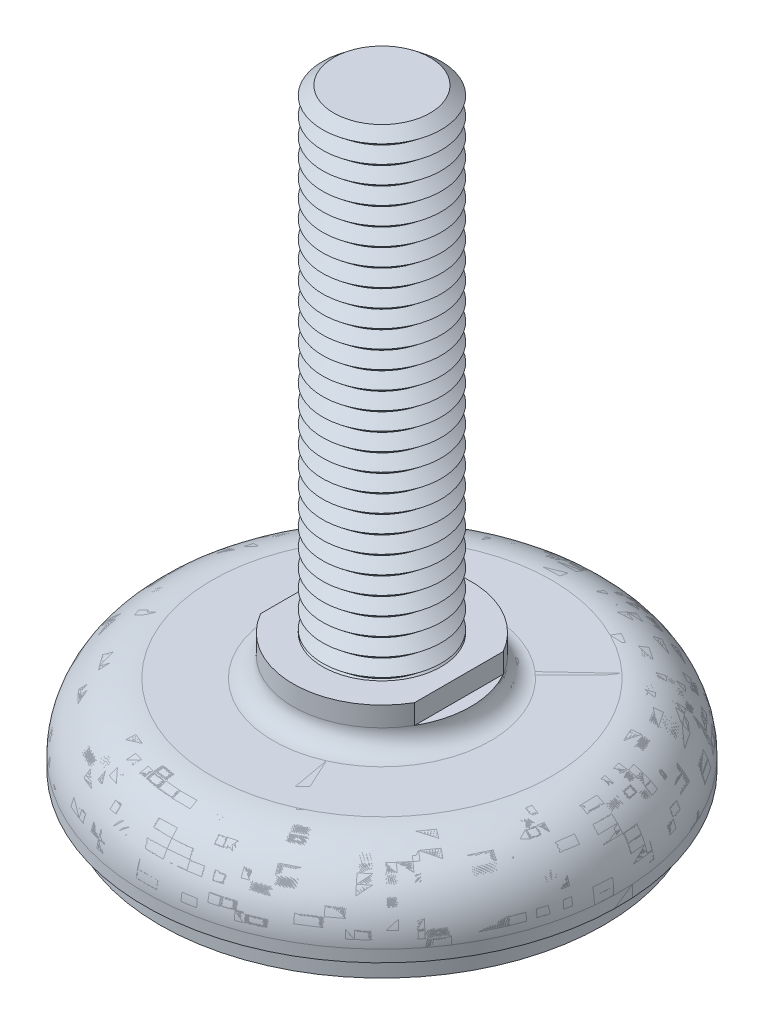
ISO-10303-21;
HEADER;
FILE_DESCRIPTION(('STEP AP214'),'2;1');
FILE_NAME('part.step','',(''),(''),'','','');
FILE_SCHEMA(('AUTOMOTIVE_DESIGN { 1 0 10303 214 1 1 1 1 }'));
ENDSEC;
DATA;
#1=APPLICATION_CONTEXT('core data for automotive mechanical design processes');
#2=APPLICATION_PROTOCOL_DEFINITION('international standard','automotive_design',2000,#1);
#3=PRODUCT_CONTEXT('',#1,'mechanical');
#4=PRODUCT('Part','Part','',(#3));
#5=PRODUCT_RELATED_PRODUCT_CATEGORY('part','',(#4));
#6=PRODUCT_DEFINITION_FORMATION('','',#4);
#7=PRODUCT_DEFINITION_CONTEXT('part definition',#1,'design');
#8=PRODUCT_DEFINITION('design','',#6,#7);
#9=PRODUCT_DEFINITION_SHAPE('','',#8);
#10=(LENGTH_UNIT() NAMED_UNIT(*) SI_UNIT(.MILLI.,.METRE.));
#11=(NAMED_UNIT(*) PLANE_ANGLE_UNIT() SI_UNIT($,.RADIAN.));
#12=(NAMED_UNIT(*) SI_UNIT($,.STERADIAN.) SOLID_ANGLE_UNIT());
#13=UNCERTAINTY_MEASURE_WITH_UNIT(LENGTH_MEASURE(1.E-05),#10,'distance_accuracy_value','');
#14=(GEOMETRIC_REPRESENTATION_CONTEXT(3) GLOBAL_UNCERTAINTY_ASSIGNED_CONTEXT((#13)) GLOBAL_UNIT_ASSIGNED_CONTEXT((#10,
#11,#12)) REPRESENTATION_CONTEXT('',''));
#15=CARTESIAN_POINT('',(0.,0.,0.));
#16=DIRECTION('',(0.,0.,1.));
#17=DIRECTION('',(1.,0.,0.));
#18=AXIS2_PLACEMENT_3D('',#15,#16,#17);
#19=CARTESIAN_POINT('',(0.,47.5,0.));
#20=DIRECTION('',(0.,-1.,0.));
#21=DIRECTION('',(0.998136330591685,0.,-0.0610234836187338));
#22=AXIS2_PLACEMENT_3D('',#19,#20,#21);
#23=CONICAL_SURFACE('',#22,4.06325030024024,0.895664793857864);
#24=CARTESIAN_POINT('',(0.,46.75,0.));
#25=DIRECTION('',(0.,-1.,0.));
#26=DIRECTION('',(0.998136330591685,0.,-0.0610234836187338));
#27=AXIS2_PLACEMENT_3D('',#24,#25,#26);
#28=CIRCLE('',#27,5.);
#29=CARTESIAN_POINT('',(4.99068165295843,46.75,-0.305117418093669));
#30=VERTEX_POINT('',#29);
#31=EDGE_CURVE('P0_E37',#30,#30,#28,.T.);
#32=ORIENTED_EDGE('',*,*,#31,.F.);
#33=EDGE_LOOP('',(#32));
#34=FACE_BOUND('',#33,.T.);
#35=CARTESIAN_POINT('',(0.,47.5,0.));
#36=DIRECTION('',(0.,-1.,0.));
#37=DIRECTION('',(0.998136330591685,0.,-0.0610234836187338));
#38=AXIS2_PLACEMENT_3D('',#35,#36,#37);
#39=CIRCLE('',#38,4.06325030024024);
#40=CARTESIAN_POINT('',(4.05567774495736,47.5,-0.247953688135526));
#41=VERTEX_POINT('',#40);
#42=EDGE_CURVE('P0_E25',#41,#41,#39,.T.);
#43=ORIENTED_EDGE('',*,*,#42,.T.);
#44=EDGE_LOOP('',(#43));
#45=FACE_BOUND('',#44,.T.);
#46=ADVANCED_FACE('P0_F14',(#34,#45),#23,.T.);
#47=CARTESIAN_POINT('',(0.,48.25,0.));
#48=DIRECTION('',(0.,1.,0.));
#49=DIRECTION('',(-0.998136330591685,0.,0.0610234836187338));
#50=AXIS2_PLACEMENT_3D('',#47,#48,#49);
#51=CONICAL_SURFACE('',#50,5.,0.895664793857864);
#52=ORIENTED_EDGE('',*,*,#42,.F.);
#53=EDGE_LOOP('',(#52));
#54=FACE_BOUND('',#53,.T.);
#55=CARTESIAN_POINT('',(0.,48.25,0.));
#56=DIRECTION('',(0.,-1.,0.));
#57=DIRECTION('',(0.998136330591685,0.,-0.0610234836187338));
#58=AXIS2_PLACEMENT_3D('',#55,#56,#57);
#59=CIRCLE('',#58,5.);
#60=CARTESIAN_POINT('',(4.99068165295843,48.25,-0.305117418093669));
#61=VERTEX_POINT('',#60);
#62=EDGE_CURVE('P0_E29',#61,#61,#59,.T.);
#63=ORIENTED_EDGE('',*,*,#62,.T.);
#64=EDGE_LOOP('',(#63));
#65=FACE_BOUND('',#64,.T.);
#66=ADVANCED_FACE('P0_F565',(#54,#65),#51,.T.);
#67=CARTESIAN_POINT('',(0.,49.,0.));
#68=DIRECTION('',(0.,1.,0.));
#69=DIRECTION('',(-0.998136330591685,0.,0.0610234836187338));
#70=AXIS2_PLACEMENT_3D('',#67,#68,#69);
#71=PLANE('',#70);
#72=CARTESIAN_POINT('',(0.,49.,0.));
#73=DIRECTION('',(0.,-1.,0.));
#74=DIRECTION('',(0.998136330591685,0.,-0.0610234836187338));
#75=AXIS2_PLACEMENT_3D('',#72,#73,#74);
#76=CIRCLE('',#75,4.06325030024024);
#77=CARTESIAN_POINT('',(4.05567774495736,49.,-0.247953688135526));
#78=VERTEX_POINT('',#77);
#79=EDGE_CURVE('P0_E21',#78,#78,#76,.T.);
#80=ORIENTED_EDGE('',*,*,#79,.F.);
#81=EDGE_LOOP('',(#80));
#82=FACE_BOUND('',#81,.T.);
#83=ADVANCED_FACE('P0_F571',(#82),#71,.T.);
#84=CARTESIAN_POINT('',(0.,49.,0.));
#85=DIRECTION('',(0.,-1.,0.));
#86=DIRECTION('',(0.998136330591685,0.,-0.0610234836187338));
#87=AXIS2_PLACEMENT_3D('',#84,#85,#86);
#88=CONICAL_SURFACE('',#87,4.06325030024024,0.895664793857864);
#89=ORIENTED_EDGE('',*,*,#62,.F.);
#90=EDGE_LOOP('',(#89));
#91=FACE_BOUND('',#90,.T.);
#92=ORIENTED_EDGE('',*,*,#79,.T.);
#93=EDGE_LOOP('',(#92));
#94=FACE_BOUND('',#93,.T.);
#95=ADVANCED_FACE('P0_F554',(#91,#94),#88,.T.);
#96=CARTESIAN_POINT('',(0.,46.,0.));
#97=DIRECTION('',(0.,-1.,0.));
#98=DIRECTION('',(0.998136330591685,0.,-0.0610234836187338));
#99=AXIS2_PLACEMENT_3D('',#96,#97,#98);
#100=CONICAL_SURFACE('',#99,4.06325030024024,0.895664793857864);
#101=CARTESIAN_POINT('',(0.,45.25,0.));
#102=DIRECTION('',(0.,-1.,0.));
#103=DIRECTION('',(0.998136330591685,0.,-0.0610234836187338));
#104=AXIS2_PLACEMENT_3D('',#101,#102,#103);
#105=CIRCLE('',#104,5.);
#106=CARTESIAN_POINT('',(4.99068165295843,45.25,-0.305117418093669));
#107=VERTEX_POINT('',#106);
#108=EDGE_CURVE('P0_E43',#107,#107,#105,.T.);
#109=ORIENTED_EDGE('',*,*,#108,.F.);
#110=EDGE_LOOP('',(#109));
#111=FACE_BOUND('',#110,.T.);
#112=CARTESIAN_POINT('',(0.,46.,0.));
#113=DIRECTION('',(0.,-1.,0.));
#114=DIRECTION('',(0.998136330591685,0.,-0.0610234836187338));
#115=AXIS2_PLACEMENT_3D('',#112,#113,#114);
#116=CIRCLE('',#115,4.06325030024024);
#117=CARTESIAN_POINT('',(4.05567774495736,46.,-0.247953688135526));
#118=VERTEX_POINT('',#117);
#119=EDGE_CURVE('P0_E34',#118,#118,#116,.T.);
#120=ORIENTED_EDGE('',*,*,#119,.T.);
#121=EDGE_LOOP('',(#120));
#122=FACE_BOUND('',#121,.T.);
#123=ADVANCED_FACE('P0_F551',(#111,#122),#100,.T.);
#124=CARTESIAN_POINT('',(0.,46.75,0.));
#125=DIRECTION('',(0.,1.,0.));
#126=DIRECTION('',(-0.998136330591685,0.,0.0610234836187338));
#127=AXIS2_PLACEMENT_3D('',#124,#125,#126);
#128=CONICAL_SURFACE('',#127,5.,0.895664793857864);
#129=ORIENTED_EDGE('',*,*,#119,.F.);
#130=EDGE_LOOP('',(#129));
#131=FACE_BOUND('',#130,.T.);
#132=ORIENTED_EDGE('',*,*,#31,.T.);
#133=EDGE_LOOP('',(#132));
#134=FACE_BOUND('',#133,.T.);
#135=ADVANCED_FACE('P0_F542',(#131,#134),#128,.T.);
#136=CARTESIAN_POINT('',(0.,44.5,0.));
#137=DIRECTION('',(0.,-1.,0.));
#138=DIRECTION('',(0.998136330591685,0.,-0.0610234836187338));
#139=AXIS2_PLACEMENT_3D('',#136,#137,#138);
#140=CONICAL_SURFACE('',#139,4.06325030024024,0.895664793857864);
#141=CARTESIAN_POINT('',(0.,43.75,0.));
#142=DIRECTION('',(0.,-1.,0.));
#143=DIRECTION('',(0.998136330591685,0.,-0.0610234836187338));
#144=AXIS2_PLACEMENT_3D('',#141,#142,#143);
#145=CIRCLE('',#144,5.);
#146=CARTESIAN_POINT('',(4.99068165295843,43.75,-0.305117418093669));
#147=VERTEX_POINT('',#146);
#148=EDGE_CURVE('P0_E49',#147,#147,#145,.T.);
#149=ORIENTED_EDGE('',*,*,#148,.F.);
#150=EDGE_LOOP('',(#149));
#151=FACE_BOUND('',#150,.T.);
#152=CARTESIAN_POINT('',(0.,44.5,0.));
#153=DIRECTION('',(0.,-1.,0.));
#154=DIRECTION('',(0.998136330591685,0.,-0.0610234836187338));
#155=AXIS2_PLACEMENT_3D('',#152,#153,#154);
#156=CIRCLE('',#155,4.06325030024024);
#157=CARTESIAN_POINT('',(4.05567774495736,44.5,-0.247953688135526));
#158=VERTEX_POINT('',#157);
#159=EDGE_CURVE('P0_E40',#158,#158,#156,.T.);
#160=ORIENTED_EDGE('',*,*,#159,.T.);
#161=EDGE_LOOP('',(#160));
#162=FACE_BOUND('',#161,.T.);
#163=ADVANCED_FACE('P0_F539',(#151,#162),#140,.T.);
#164=CARTESIAN_POINT('',(0.,45.25,0.));
#165=DIRECTION('',(0.,1.,0.));
#166=DIRECTION('',(-0.998136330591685,0.,0.0610234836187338));
#167=AXIS2_PLACEMENT_3D('',#164,#165,#166);
#168=CONICAL_SURFACE('',#167,5.,0.895664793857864);
#169=ORIENTED_EDGE('',*,*,#159,.F.);
#170=EDGE_LOOP('',(#169));
#171=FACE_BOUND('',#170,.T.);
#172=ORIENTED_EDGE('',*,*,#108,.T.);
#173=EDGE_LOOP('',(#172));
#174=FACE_BOUND('',#173,.T.);
#175=ADVANCED_FACE('P0_F530',(#171,#174),#168,.T.);
#176=CARTESIAN_POINT('',(0.,43.,0.));
#177=DIRECTION('',(0.,-1.,0.));
#178=DIRECTION('',(0.998136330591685,0.,-0.0610234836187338));
#179=AXIS2_PLACEMENT_3D('',#176,#177,#178);
#180=CONICAL_SURFACE('',#179,4.06325030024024,0.895664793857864);
#181=CARTESIAN_POINT('',(0.,42.25,0.));
#182=DIRECTION('',(0.,-1.,0.));
#183=DIRECTION('',(0.998136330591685,0.,-0.0610234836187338));
#184=AXIS2_PLACEMENT_3D('',#181,#182,#183);
#185=CIRCLE('',#184,5.);
#186=CARTESIAN_POINT('',(4.99068165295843,42.25,-0.305117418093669));
#187=VERTEX_POINT('',#186);
#188=EDGE_CURVE('P0_E55',#187,#187,#185,.T.);
#189=ORIENTED_EDGE('',*,*,#188,.F.);
#190=EDGE_LOOP('',(#189));
#191=FACE_BOUND('',#190,.T.);
#192=CARTESIAN_POINT('',(0.,43.,0.));
#193=DIRECTION('',(0.,-1.,0.));
#194=DIRECTION('',(0.998136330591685,0.,-0.0610234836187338));
#195=AXIS2_PLACEMENT_3D('',#192,#193,#194);
#196=CIRCLE('',#195,4.06325030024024);
#197=CARTESIAN_POINT('',(4.05567774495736,43.,-0.247953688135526));
#198=VERTEX_POINT('',#197);
#199=EDGE_CURVE('P0_E46',#198,#198,#196,.T.);
#200=ORIENTED_EDGE('',*,*,#199,.T.);
#201=EDGE_LOOP('',(#200));
#202=FACE_BOUND('',#201,.T.);
#203=ADVANCED_FACE('P0_F527',(#191,#202),#180,.T.);
#204=CARTESIAN_POINT('',(0.,43.75,0.));
#205=DIRECTION('',(0.,1.,0.));
#206=DIRECTION('',(-0.998136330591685,0.,0.0610234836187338));
#207=AXIS2_PLACEMENT_3D('',#204,#205,#206);
#208=CONICAL_SURFACE('',#207,5.,0.895664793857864);
#209=ORIENTED_EDGE('',*,*,#199,.F.);
#210=EDGE_LOOP('',(#209));
#211=FACE_BOUND('',#210,.T.);
#212=ORIENTED_EDGE('',*,*,#148,.T.);
#213=EDGE_LOOP('',(#212));
#214=FACE_BOUND('',#213,.T.);
#215=ADVANCED_FACE('P0_F518',(#211,#214),#208,.T.);
#216=CARTESIAN_POINT('',(0.,41.5,0.));
#217=DIRECTION('',(0.,-1.,0.));
#218=DIRECTION('',(0.998136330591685,0.,-0.0610234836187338));
#219=AXIS2_PLACEMENT_3D('',#216,#217,#218);
#220=CONICAL_SURFACE('',#219,4.06325030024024,0.895664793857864);
#221=CARTESIAN_POINT('',(0.,40.75,0.));
#222=DIRECTION('',(0.,-1.,0.));
#223=DIRECTION('',(0.998136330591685,0.,-0.0610234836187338));
#224=AXIS2_PLACEMENT_3D('',#221,#222,#223);
#225=CIRCLE('',#224,5.);
#226=CARTESIAN_POINT('',(4.99068165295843,40.75,-0.305117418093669));
#227=VERTEX_POINT('',#226);
#228=EDGE_CURVE('P0_E61',#227,#227,#225,.T.);
#229=ORIENTED_EDGE('',*,*,#228,.F.);
#230=EDGE_LOOP('',(#229));
#231=FACE_BOUND('',#230,.T.);
#232=CARTESIAN_POINT('',(0.,41.5,0.));
#233=DIRECTION('',(0.,-1.,0.));
#234=DIRECTION('',(0.998136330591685,0.,-0.0610234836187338));
#235=AXIS2_PLACEMENT_3D('',#232,#233,#234);
#236=CIRCLE('',#235,4.06325030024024);
#237=CARTESIAN_POINT('',(4.05567774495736,41.5,-0.247953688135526));
#238=VERTEX_POINT('',#237);
#239=EDGE_CURVE('P0_E52',#238,#238,#236,.T.);
#240=ORIENTED_EDGE('',*,*,#239,.T.);
#241=EDGE_LOOP('',(#240));
#242=FACE_BOUND('',#241,.T.);
#243=ADVANCED_FACE('P0_F515',(#231,#242),#220,.T.);
#244=CARTESIAN_POINT('',(0.,42.25,0.));
#245=DIRECTION('',(0.,1.,0.));
#246=DIRECTION('',(-0.998136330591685,0.,0.0610234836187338));
#247=AXIS2_PLACEMENT_3D('',#244,#245,#246);
#248=CONICAL_SURFACE('',#247,5.,0.895664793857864);
#249=ORIENTED_EDGE('',*,*,#239,.F.);
#250=EDGE_LOOP('',(#249));
#251=FACE_BOUND('',#250,.T.);
#252=ORIENTED_EDGE('',*,*,#188,.T.);
#253=EDGE_LOOP('',(#252));
#254=FACE_BOUND('',#253,.T.);
#255=ADVANCED_FACE('P0_F506',(#251,#254),#248,.T.);
#256=CARTESIAN_POINT('',(0.,40.,0.));
#257=DIRECTION('',(0.,-1.,0.));
#258=DIRECTION('',(0.998136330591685,0.,-0.0610234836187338));
#259=AXIS2_PLACEMENT_3D('',#256,#257,#258);
#260=CONICAL_SURFACE('',#259,4.06325030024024,0.895664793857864);
#261=CARTESIAN_POINT('',(0.,39.25,0.));
#262=DIRECTION('',(0.,-1.,0.));
#263=DIRECTION('',(0.998136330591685,0.,-0.0610234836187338));
#264=AXIS2_PLACEMENT_3D('',#261,#262,#263);
#265=CIRCLE('',#264,5.);
#266=CARTESIAN_POINT('',(4.99068165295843,39.25,-0.305117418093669));
#267=VERTEX_POINT('',#266);
#268=EDGE_CURVE('P0_E67',#267,#267,#265,.T.);
#269=ORIENTED_EDGE('',*,*,#268,.F.);
#270=EDGE_LOOP('',(#269));
#271=FACE_BOUND('',#270,.T.);
#272=CARTESIAN_POINT('',(0.,40.,0.));
#273=DIRECTION('',(0.,-1.,0.));
#274=DIRECTION('',(0.998136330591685,0.,-0.0610234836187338));
#275=AXIS2_PLACEMENT_3D('',#272,#273,#274);
#276=CIRCLE('',#275,4.06325030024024);
#277=CARTESIAN_POINT('',(4.05567774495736,40.,-0.247953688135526));
#278=VERTEX_POINT('',#277);
#279=EDGE_CURVE('P0_E58',#278,#278,#276,.T.);
#280=ORIENTED_EDGE('',*,*,#279,.T.);
#281=EDGE_LOOP('',(#280));
#282=FACE_BOUND('',#281,.T.);
#283=ADVANCED_FACE('P0_F503',(#271,#282),#260,.T.);
#284=CARTESIAN_POINT('',(0.,40.75,0.));
#285=DIRECTION('',(0.,1.,0.));
#286=DIRECTION('',(-0.998136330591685,0.,0.0610234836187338));
#287=AXIS2_PLACEMENT_3D('',#284,#285,#286);
#288=CONICAL_SURFACE('',#287,5.,0.895664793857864);
#289=ORIENTED_EDGE('',*,*,#279,.F.);
#290=EDGE_LOOP('',(#289));
#291=FACE_BOUND('',#290,.T.);
#292=ORIENTED_EDGE('',*,*,#228,.T.);
#293=EDGE_LOOP('',(#292));
#294=FACE_BOUND('',#293,.T.);
#295=ADVANCED_FACE('P0_F494',(#291,#294),#288,.T.);
#296=CARTESIAN_POINT('',(0.,38.5,0.));
#297=DIRECTION('',(0.,-1.,0.));
#298=DIRECTION('',(0.998136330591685,0.,-0.0610234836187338));
#299=AXIS2_PLACEMENT_3D('',#296,#297,#298);
#300=CONICAL_SURFACE('',#299,4.06325030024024,0.895664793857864);
#301=CARTESIAN_POINT('',(0.,37.75,0.));
#302=DIRECTION('',(0.,-1.,0.));
#303=DIRECTION('',(0.998136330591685,0.,-0.0610234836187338));
#304=AXIS2_PLACEMENT_3D('',#301,#302,#303);
#305=CIRCLE('',#304,5.);
#306=CARTESIAN_POINT('',(4.99068165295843,37.75,-0.305117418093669));
#307=VERTEX_POINT('',#306);
#308=EDGE_CURVE('P0_E73',#307,#307,#305,.T.);
#309=ORIENTED_EDGE('',*,*,#308,.F.);
#310=EDGE_LOOP('',(#309));
#311=FACE_BOUND('',#310,.T.);
#312=CARTESIAN_POINT('',(0.,38.5,0.));
#313=DIRECTION('',(0.,-1.,0.));
#314=DIRECTION('',(0.998136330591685,0.,-0.0610234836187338));
#315=AXIS2_PLACEMENT_3D('',#312,#313,#314);
#316=CIRCLE('',#315,4.06325030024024);
#317=CARTESIAN_POINT('',(4.05567774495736,38.5,-0.247953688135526));
#318=VERTEX_POINT('',#317);
#319=EDGE_CURVE('P0_E64',#318,#318,#316,.T.);
#320=ORIENTED_EDGE('',*,*,#319,.T.);
#321=EDGE_LOOP('',(#320));
#322=FACE_BOUND('',#321,.T.);
#323=ADVANCED_FACE('P0_F491',(#311,#322),#300,.T.);
#324=CARTESIAN_POINT('',(0.,39.25,0.));
#325=DIRECTION('',(0.,1.,0.));
#326=DIRECTION('',(-0.998136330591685,0.,0.0610234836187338));
#327=AXIS2_PLACEMENT_3D('',#324,#325,#326);
#328=CONICAL_SURFACE('',#327,5.,0.895664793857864);
#329=ORIENTED_EDGE('',*,*,#319,.F.);
#330=EDGE_LOOP('',(#329));
#331=FACE_BOUND('',#330,.T.);
#332=ORIENTED_EDGE('',*,*,#268,.T.);
#333=EDGE_LOOP('',(#332));
#334=FACE_BOUND('',#333,.T.);
#335=ADVANCED_FACE('P0_F482',(#331,#334),#328,.T.);
#336=CARTESIAN_POINT('',(0.,37.,0.));
#337=DIRECTION('',(0.,-1.,0.));
#338=DIRECTION('',(0.998136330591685,0.,-0.0610234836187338));
#339=AXIS2_PLACEMENT_3D('',#336,#337,#338);
#340=CONICAL_SURFACE('',#339,4.06325030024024,0.895664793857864);
#341=CARTESIAN_POINT('',(0.,36.25,0.));
#342=DIRECTION('',(0.,-1.,0.));
#343=DIRECTION('',(0.998136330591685,0.,-0.0610234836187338));
#344=AXIS2_PLACEMENT_3D('',#341,#342,#343);
#345=CIRCLE('',#344,5.);
#346=CARTESIAN_POINT('',(4.99068165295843,36.25,-0.305117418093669));
#347=VERTEX_POINT('',#346);
#348=EDGE_CURVE('P0_E79',#347,#347,#345,.T.);
#349=ORIENTED_EDGE('',*,*,#348,.F.);
#350=EDGE_LOOP('',(#349));
#351=FACE_BOUND('',#350,.T.);
#352=CARTESIAN_POINT('',(0.,37.,0.));
#353=DIRECTION('',(0.,-1.,0.));
#354=DIRECTION('',(0.998136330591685,0.,-0.0610234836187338));
#355=AXIS2_PLACEMENT_3D('',#352,#353,#354);
#356=CIRCLE('',#355,4.06325030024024);
#357=CARTESIAN_POINT('',(4.05567774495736,37.,-0.247953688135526));
#358=VERTEX_POINT('',#357);
#359=EDGE_CURVE('P0_E70',#358,#358,#356,.T.);
#360=ORIENTED_EDGE('',*,*,#359,.T.);
#361=EDGE_LOOP('',(#360));
#362=FACE_BOUND('',#361,.T.);
#363=ADVANCED_FACE('P0_F479',(#351,#362),#340,.T.);
#364=CARTESIAN_POINT('',(0.,37.75,0.));
#365=DIRECTION('',(0.,1.,0.));
#366=DIRECTION('',(-0.998136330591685,0.,0.0610234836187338));
#367=AXIS2_PLACEMENT_3D('',#364,#365,#366);
#368=CONICAL_SURFACE('',#367,5.,0.895664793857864);
#369=ORIENTED_EDGE('',*,*,#359,.F.);
#370=EDGE_LOOP('',(#369));
#371=FACE_BOUND('',#370,.T.);
#372=ORIENTED_EDGE('',*,*,#308,.T.);
#373=EDGE_LOOP('',(#372));
#374=FACE_BOUND('',#373,.T.);
#375=ADVANCED_FACE('P0_F470',(#371,#374),#368,.T.);
#376=CARTESIAN_POINT('',(0.,35.5,0.));
#377=DIRECTION('',(0.,-1.,0.));
#378=DIRECTION('',(0.998136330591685,0.,-0.0610234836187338));
#379=AXIS2_PLACEMENT_3D('',#376,#377,#378);
#380=CONICAL_SURFACE('',#379,4.06325030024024,0.895664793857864);
#381=CARTESIAN_POINT('',(0.,34.75,0.));
#382=DIRECTION('',(0.,-1.,0.));
#383=DIRECTION('',(0.998136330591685,0.,-0.0610234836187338));
#384=AXIS2_PLACEMENT_3D('',#381,#382,#383);
#385=CIRCLE('',#384,5.);
#386=CARTESIAN_POINT('',(4.99068165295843,34.75,-0.305117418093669));
#387=VERTEX_POINT('',#386);
#388=EDGE_CURVE('P0_E85',#387,#387,#385,.T.);
#389=ORIENTED_EDGE('',*,*,#388,.F.);
#390=EDGE_LOOP('',(#389));
#391=FACE_BOUND('',#390,.T.);
#392=CARTESIAN_POINT('',(0.,35.5,0.));
#393=DIRECTION('',(0.,-1.,0.));
#394=DIRECTION('',(0.998136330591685,0.,-0.0610234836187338));
#395=AXIS2_PLACEMENT_3D('',#392,#393,#394);
#396=CIRCLE('',#395,4.06325030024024);
#397=CARTESIAN_POINT('',(4.05567774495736,35.5,-0.247953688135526));
#398=VERTEX_POINT('',#397);
#399=EDGE_CURVE('P0_E76',#398,#398,#396,.T.);
#400=ORIENTED_EDGE('',*,*,#399,.T.);
#401=EDGE_LOOP('',(#400));
#402=FACE_BOUND('',#401,.T.);
#403=ADVANCED_FACE('P0_F467',(#391,#402),#380,.T.);
#404=CARTESIAN_POINT('',(0.,36.25,0.));
#405=DIRECTION('',(0.,1.,0.));
#406=DIRECTION('',(-0.998136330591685,0.,0.0610234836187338));
#407=AXIS2_PLACEMENT_3D('',#404,#405,#406);
#408=CONICAL_SURFACE('',#407,5.,0.895664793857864);
#409=ORIENTED_EDGE('',*,*,#399,.F.);
#410=EDGE_LOOP('',(#409));
#411=FACE_BOUND('',#410,.T.);
#412=ORIENTED_EDGE('',*,*,#348,.T.);
#413=EDGE_LOOP('',(#412));
#414=FACE_BOUND('',#413,.T.);
#415=ADVANCED_FACE('P0_F458',(#411,#414),#408,.T.);
#416=CARTESIAN_POINT('',(0.,34.,0.));
#417=DIRECTION('',(0.,-1.,0.));
#418=DIRECTION('',(0.998136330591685,0.,-0.0610234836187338));
#419=AXIS2_PLACEMENT_3D('',#416,#417,#418);
#420=CONICAL_SURFACE('',#419,4.06325030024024,0.895664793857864);
#421=CARTESIAN_POINT('',(0.,33.25,0.));
#422=DIRECTION('',(0.,-1.,0.));
#423=DIRECTION('',(0.998136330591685,0.,-0.0610234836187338));
#424=AXIS2_PLACEMENT_3D('',#421,#422,#423);
#425=CIRCLE('',#424,5.);
#426=CARTESIAN_POINT('',(4.99068165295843,33.25,-0.305117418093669));
#427=VERTEX_POINT('',#426);
#428=EDGE_CURVE('P0_E91',#427,#427,#425,.T.);
#429=ORIENTED_EDGE('',*,*,#428,.F.);
#430=EDGE_LOOP('',(#429));
#431=FACE_BOUND('',#430,.T.);
#432=CARTESIAN_POINT('',(0.,34.,0.));
#433=DIRECTION('',(0.,-1.,0.));
#434=DIRECTION('',(0.998136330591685,0.,-0.0610234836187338));
#435=AXIS2_PLACEMENT_3D('',#432,#433,#434);
#436=CIRCLE('',#435,4.06325030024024);
#437=CARTESIAN_POINT('',(4.05567774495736,34.,-0.247953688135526));
#438=VERTEX_POINT('',#437);
#439=EDGE_CURVE('P0_E82',#438,#438,#436,.T.);
#440=ORIENTED_EDGE('',*,*,#439,.T.);
#441=EDGE_LOOP('',(#440));
#442=FACE_BOUND('',#441,.T.);
#443=ADVANCED_FACE('P0_F455',(#431,#442),#420,.T.);
#444=CARTESIAN_POINT('',(0.,34.75,0.));
#445=DIRECTION('',(0.,1.,0.));
#446=DIRECTION('',(-0.998136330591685,0.,0.0610234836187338));
#447=AXIS2_PLACEMENT_3D('',#444,#445,#446);
#448=CONICAL_SURFACE('',#447,5.,0.895664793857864);
#449=ORIENTED_EDGE('',*,*,#439,.F.);
#450=EDGE_LOOP('',(#449));
#451=FACE_BOUND('',#450,.T.);
#452=ORIENTED_EDGE('',*,*,#388,.T.);
#453=EDGE_LOOP('',(#452));
#454=FACE_BOUND('',#453,.T.);
#455=ADVANCED_FACE('P0_F446',(#451,#454),#448,.T.);
#456=CARTESIAN_POINT('',(0.,32.5,0.));
#457=DIRECTION('',(0.,-1.,0.));
#458=DIRECTION('',(0.998136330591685,0.,-0.0610234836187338));
#459=AXIS2_PLACEMENT_3D('',#456,#457,#458);
#460=CONICAL_SURFACE('',#459,4.06325030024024,0.895664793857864);
#461=CARTESIAN_POINT('',(0.,31.75,0.));
#462=DIRECTION('',(0.,-1.,0.));
#463=DIRECTION('',(0.998136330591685,0.,-0.0610234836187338));
#464=AXIS2_PLACEMENT_3D('',#461,#462,#463);
#465=CIRCLE('',#464,5.);
#466=CARTESIAN_POINT('',(4.99068165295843,31.75,-0.305117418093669));
#467=VERTEX_POINT('',#466);
#468=EDGE_CURVE('P0_E97',#467,#467,#465,.T.);
#469=ORIENTED_EDGE('',*,*,#468,.F.);
#470=EDGE_LOOP('',(#469));
#471=FACE_BOUND('',#470,.T.);
#472=CARTESIAN_POINT('',(0.,32.5,0.));
#473=DIRECTION('',(0.,-1.,0.));
#474=DIRECTION('',(0.998136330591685,0.,-0.0610234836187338));
#475=AXIS2_PLACEMENT_3D('',#472,#473,#474);
#476=CIRCLE('',#475,4.06325030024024);
#477=CARTESIAN_POINT('',(4.05567774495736,32.5,-0.247953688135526));
#478=VERTEX_POINT('',#477);
#479=EDGE_CURVE('P0_E88',#478,#478,#476,.T.);
#480=ORIENTED_EDGE('',*,*,#479,.T.);
#481=EDGE_LOOP('',(#480));
#482=FACE_BOUND('',#481,.T.);
#483=ADVANCED_FACE('P0_F443',(#471,#482),#460,.T.);
#484=CARTESIAN_POINT('',(0.,33.25,0.));
#485=DIRECTION('',(0.,1.,0.));
#486=DIRECTION('',(-0.998136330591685,0.,0.0610234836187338));
#487=AXIS2_PLACEMENT_3D('',#484,#485,#486);
#488=CONICAL_SURFACE('',#487,5.,0.895664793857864);
#489=ORIENTED_EDGE('',*,*,#479,.F.);
#490=EDGE_LOOP('',(#489));
#491=FACE_BOUND('',#490,.T.);
#492=ORIENTED_EDGE('',*,*,#428,.T.);
#493=EDGE_LOOP('',(#492));
#494=FACE_BOUND('',#493,.T.);
#495=ADVANCED_FACE('P0_F434',(#491,#494),#488,.T.);
#496=CARTESIAN_POINT('',(0.,31.,0.));
#497=DIRECTION('',(0.,-1.,0.));
#498=DIRECTION('',(0.998136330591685,0.,-0.0610234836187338));
#499=AXIS2_PLACEMENT_3D('',#496,#497,#498);
#500=CONICAL_SURFACE('',#499,4.06325030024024,0.895664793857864);
#501=CARTESIAN_POINT('',(0.,30.25,0.));
#502=DIRECTION('',(0.,-1.,0.));
#503=DIRECTION('',(0.998136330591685,0.,-0.0610234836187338));
#504=AXIS2_PLACEMENT_3D('',#501,#502,#503);
#505=CIRCLE('',#504,5.);
#506=CARTESIAN_POINT('',(4.99068165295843,30.25,-0.305117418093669));
#507=VERTEX_POINT('',#506);
#508=EDGE_CURVE('P0_E103',#507,#507,#505,.T.);
#509=ORIENTED_EDGE('',*,*,#508,.F.);
#510=EDGE_LOOP('',(#509));
#511=FACE_BOUND('',#510,.T.);
#512=CARTESIAN_POINT('',(0.,31.,0.));
#513=DIRECTION('',(0.,-1.,0.));
#514=DIRECTION('',(0.998136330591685,0.,-0.0610234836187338));
#515=AXIS2_PLACEMENT_3D('',#512,#513,#514);
#516=CIRCLE('',#515,4.06325030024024);
#517=CARTESIAN_POINT('',(4.05567774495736,31.,-0.247953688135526));
#518=VERTEX_POINT('',#517);
#519=EDGE_CURVE('P0_E94',#518,#518,#516,.T.);
#520=ORIENTED_EDGE('',*,*,#519,.T.);
#521=EDGE_LOOP('',(#520));
#522=FACE_BOUND('',#521,.T.);
#523=ADVANCED_FACE('P0_F431',(#511,#522),#500,.T.);
#524=CARTESIAN_POINT('',(0.,31.75,0.));
#525=DIRECTION('',(0.,1.,0.));
#526=DIRECTION('',(-0.998136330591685,0.,0.0610234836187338));
#527=AXIS2_PLACEMENT_3D('',#524,#525,#526);
#528=CONICAL_SURFACE('',#527,5.,0.895664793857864);
#529=ORIENTED_EDGE('',*,*,#519,.F.);
#530=EDGE_LOOP('',(#529));
#531=FACE_BOUND('',#530,.T.);
#532=ORIENTED_EDGE('',*,*,#468,.T.);
#533=EDGE_LOOP('',(#532));
#534=FACE_BOUND('',#533,.T.);
#535=ADVANCED_FACE('P0_F422',(#531,#534),#528,.T.);
#536=CARTESIAN_POINT('',(0.,29.5,0.));
#537=DIRECTION('',(0.,-1.,0.));
#538=DIRECTION('',(0.998136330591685,0.,-0.0610234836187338));
#539=AXIS2_PLACEMENT_3D('',#536,#537,#538);
#540=CONICAL_SURFACE('',#539,4.06325030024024,0.895664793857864);
#541=CARTESIAN_POINT('',(0.,28.75,0.));
#542=DIRECTION('',(0.,-1.,0.));
#543=DIRECTION('',(0.998136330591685,0.,-0.0610234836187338));
#544=AXIS2_PLACEMENT_3D('',#541,#542,#543);
#545=CIRCLE('',#544,5.);
#546=CARTESIAN_POINT('',(4.99068165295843,28.75,-0.305117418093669));
#547=VERTEX_POINT('',#546);
#548=EDGE_CURVE('P0_E109',#547,#547,#545,.T.);
#549=ORIENTED_EDGE('',*,*,#548,.F.);
#550=EDGE_LOOP('',(#549));
#551=FACE_BOUND('',#550,.T.);
#552=CARTESIAN_POINT('',(0.,29.5,0.));
#553=DIRECTION('',(0.,-1.,0.));
#554=DIRECTION('',(0.998136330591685,0.,-0.0610234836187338));
#555=AXIS2_PLACEMENT_3D('',#552,#553,#554);
#556=CIRCLE('',#555,4.06325030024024);
#557=CARTESIAN_POINT('',(4.05567774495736,29.5,-0.247953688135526));
#558=VERTEX_POINT('',#557);
#559=EDGE_CURVE('P0_E100',#558,#558,#556,.T.);
#560=ORIENTED_EDGE('',*,*,#559,.T.);
#561=EDGE_LOOP('',(#560));
#562=FACE_BOUND('',#561,.T.);
#563=ADVANCED_FACE('P0_F419',(#551,#562),#540,.T.);
#564=CARTESIAN_POINT('',(0.,30.25,0.));
#565=DIRECTION('',(0.,1.,0.));
#566=DIRECTION('',(-0.998136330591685,0.,0.0610234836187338));
#567=AXIS2_PLACEMENT_3D('',#564,#565,#566);
#568=CONICAL_SURFACE('',#567,5.,0.895664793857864);
#569=ORIENTED_EDGE('',*,*,#559,.F.);
#570=EDGE_LOOP('',(#569));
#571=FACE_BOUND('',#570,.T.);
#572=ORIENTED_EDGE('',*,*,#508,.T.);
#573=EDGE_LOOP('',(#572));
#574=FACE_BOUND('',#573,.T.);
#575=ADVANCED_FACE('P0_F410',(#571,#574),#568,.T.);
#576=CARTESIAN_POINT('',(0.,28.,0.));
#577=DIRECTION('',(0.,-1.,0.));
#578=DIRECTION('',(0.998136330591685,0.,-0.0610234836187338));
#579=AXIS2_PLACEMENT_3D('',#576,#577,#578);
#580=CONICAL_SURFACE('',#579,4.06325030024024,0.895664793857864);
#581=CARTESIAN_POINT('',(0.,27.25,0.));
#582=DIRECTION('',(0.,-1.,0.));
#583=DIRECTION('',(0.998136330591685,0.,-0.0610234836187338));
#584=AXIS2_PLACEMENT_3D('',#581,#582,#583);
#585=CIRCLE('',#584,5.);
#586=CARTESIAN_POINT('',(4.99068165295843,27.25,-0.305117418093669));
#587=VERTEX_POINT('',#586);
#588=EDGE_CURVE('P0_E115',#587,#587,#585,.T.);
#589=ORIENTED_EDGE('',*,*,#588,.F.);
#590=EDGE_LOOP('',(#589));
#591=FACE_BOUND('',#590,.T.);
#592=CARTESIAN_POINT('',(0.,28.,0.));
#593=DIRECTION('',(0.,-1.,0.));
#594=DIRECTION('',(0.998136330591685,0.,-0.0610234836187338));
#595=AXIS2_PLACEMENT_3D('',#592,#593,#594);
#596=CIRCLE('',#595,4.06325030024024);
#597=CARTESIAN_POINT('',(4.05567774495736,28.,-0.247953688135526));
#598=VERTEX_POINT('',#597);
#599=EDGE_CURVE('P0_E106',#598,#598,#596,.T.);
#600=ORIENTED_EDGE('',*,*,#599,.T.);
#601=EDGE_LOOP('',(#600));
#602=FACE_BOUND('',#601,.T.);
#603=ADVANCED_FACE('P0_F407',(#591,#602),#580,.T.);
#604=CARTESIAN_POINT('',(0.,28.75,0.));
#605=DIRECTION('',(0.,1.,0.));
#606=DIRECTION('',(-0.998136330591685,0.,0.0610234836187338));
#607=AXIS2_PLACEMENT_3D('',#604,#605,#606);
#608=CONICAL_SURFACE('',#607,5.,0.895664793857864);
#609=ORIENTED_EDGE('',*,*,#599,.F.);
#610=EDGE_LOOP('',(#609));
#611=FACE_BOUND('',#610,.T.);
#612=ORIENTED_EDGE('',*,*,#548,.T.);
#613=EDGE_LOOP('',(#612));
#614=FACE_BOUND('',#613,.T.);
#615=ADVANCED_FACE('P0_F398',(#611,#614),#608,.T.);
#616=CARTESIAN_POINT('',(0.,26.5,0.));
#617=DIRECTION('',(0.,-1.,0.));
#618=DIRECTION('',(0.998136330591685,0.,-0.0610234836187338));
#619=AXIS2_PLACEMENT_3D('',#616,#617,#618);
#620=CONICAL_SURFACE('',#619,4.06325030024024,0.895664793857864);
#621=CARTESIAN_POINT('',(0.,25.75,0.));
#622=DIRECTION('',(0.,-1.,0.));
#623=DIRECTION('',(0.998136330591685,0.,-0.0610234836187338));
#624=AXIS2_PLACEMENT_3D('',#621,#622,#623);
#625=CIRCLE('',#624,5.);
#626=CARTESIAN_POINT('',(4.99068165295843,25.75,-0.305117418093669));
#627=VERTEX_POINT('',#626);
#628=EDGE_CURVE('P0_E121',#627,#627,#625,.T.);
#629=ORIENTED_EDGE('',*,*,#628,.F.);
#630=EDGE_LOOP('',(#629));
#631=FACE_BOUND('',#630,.T.);
#632=CARTESIAN_POINT('',(0.,26.5,0.));
#633=DIRECTION('',(0.,-1.,0.));
#634=DIRECTION('',(0.998136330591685,0.,-0.0610234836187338));
#635=AXIS2_PLACEMENT_3D('',#632,#633,#634);
#636=CIRCLE('',#635,4.06325030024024);
#637=CARTESIAN_POINT('',(4.05567774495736,26.5,-0.247953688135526));
#638=VERTEX_POINT('',#637);
#639=EDGE_CURVE('P0_E112',#638,#638,#636,.T.);
#640=ORIENTED_EDGE('',*,*,#639,.T.);
#641=EDGE_LOOP('',(#640));
#642=FACE_BOUND('',#641,.T.);
#643=ADVANCED_FACE('P0_F395',(#631,#642),#620,.T.);
#644=CARTESIAN_POINT('',(0.,27.25,0.));
#645=DIRECTION('',(0.,1.,0.));
#646=DIRECTION('',(-0.998136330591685,0.,0.0610234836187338));
#647=AXIS2_PLACEMENT_3D('',#644,#645,#646);
#648=CONICAL_SURFACE('',#647,5.,0.895664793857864);
#649=ORIENTED_EDGE('',*,*,#639,.F.);
#650=EDGE_LOOP('',(#649));
#651=FACE_BOUND('',#650,.T.);
#652=ORIENTED_EDGE('',*,*,#588,.T.);
#653=EDGE_LOOP('',(#652));
#654=FACE_BOUND('',#653,.T.);
#655=ADVANCED_FACE('P0_F386',(#651,#654),#648,.T.);
#656=CARTESIAN_POINT('',(0.,25.,0.));
#657=DIRECTION('',(0.,-1.,0.));
#658=DIRECTION('',(0.998136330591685,0.,-0.0610234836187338));
#659=AXIS2_PLACEMENT_3D('',#656,#657,#658);
#660=CONICAL_SURFACE('',#659,4.06325030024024,0.895664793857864);
#661=CARTESIAN_POINT('',(0.,24.25,0.));
#662=DIRECTION('',(0.,-1.,0.));
#663=DIRECTION('',(0.998136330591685,0.,-0.0610234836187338));
#664=AXIS2_PLACEMENT_3D('',#661,#662,#663);
#665=CIRCLE('',#664,5.);
#666=CARTESIAN_POINT('',(4.99068165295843,24.25,-0.305117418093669));
#667=VERTEX_POINT('',#666);
#668=EDGE_CURVE('P0_E127',#667,#667,#665,.T.);
#669=ORIENTED_EDGE('',*,*,#668,.F.);
#670=EDGE_LOOP('',(#669));
#671=FACE_BOUND('',#670,.T.);
#672=CARTESIAN_POINT('',(0.,25.,0.));
#673=DIRECTION('',(0.,-1.,0.));
#674=DIRECTION('',(0.998136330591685,0.,-0.0610234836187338));
#675=AXIS2_PLACEMENT_3D('',#672,#673,#674);
#676=CIRCLE('',#675,4.06325030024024);
#677=CARTESIAN_POINT('',(4.05567774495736,25.,-0.247953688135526));
#678=VERTEX_POINT('',#677);
#679=EDGE_CURVE('P0_E118',#678,#678,#676,.T.);
#680=ORIENTED_EDGE('',*,*,#679,.T.);
#681=EDGE_LOOP('',(#680));
#682=FACE_BOUND('',#681,.T.);
#683=ADVANCED_FACE('P0_F383',(#671,#682),#660,.T.);
#684=CARTESIAN_POINT('',(0.,25.75,0.));
#685=DIRECTION('',(0.,1.,0.));
#686=DIRECTION('',(-0.998136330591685,0.,0.0610234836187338));
#687=AXIS2_PLACEMENT_3D('',#684,#685,#686);
#688=CONICAL_SURFACE('',#687,5.,0.895664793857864);
#689=ORIENTED_EDGE('',*,*,#679,.F.);
#690=EDGE_LOOP('',(#689));
#691=FACE_BOUND('',#690,.T.);
#692=ORIENTED_EDGE('',*,*,#628,.T.);
#693=EDGE_LOOP('',(#692));
#694=FACE_BOUND('',#693,.T.);
#695=ADVANCED_FACE('P0_F374',(#691,#694),#688,.T.);
#696=CARTESIAN_POINT('',(0.,23.5,0.));
#697=DIRECTION('',(0.,-1.,0.));
#698=DIRECTION('',(0.998136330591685,0.,-0.0610234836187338));
#699=AXIS2_PLACEMENT_3D('',#696,#697,#698);
#700=CONICAL_SURFACE('',#699,4.06325030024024,0.895664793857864);
#701=CARTESIAN_POINT('',(0.,22.75,0.));
#702=DIRECTION('',(0.,-1.,0.));
#703=DIRECTION('',(0.998136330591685,0.,-0.0610234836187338));
#704=AXIS2_PLACEMENT_3D('',#701,#702,#703);
#705=CIRCLE('',#704,5.);
#706=CARTESIAN_POINT('',(4.99068165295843,22.75,-0.305117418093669));
#707=VERTEX_POINT('',#706);
#708=EDGE_CURVE('P0_E133',#707,#707,#705,.T.);
#709=ORIENTED_EDGE('',*,*,#708,.F.);
#710=EDGE_LOOP('',(#709));
#711=FACE_BOUND('',#710,.T.);
#712=CARTESIAN_POINT('',(0.,23.5,0.));
#713=DIRECTION('',(0.,-1.,0.));
#714=DIRECTION('',(0.998136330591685,0.,-0.0610234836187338));
#715=AXIS2_PLACEMENT_3D('',#712,#713,#714);
#716=CIRCLE('',#715,4.06325030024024);
#717=CARTESIAN_POINT('',(4.05567774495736,23.5,-0.247953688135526));
#718=VERTEX_POINT('',#717);
#719=EDGE_CURVE('P0_E124',#718,#718,#716,.T.);
#720=ORIENTED_EDGE('',*,*,#719,.T.);
#721=EDGE_LOOP('',(#720));
#722=FACE_BOUND('',#721,.T.);
#723=ADVANCED_FACE('P0_F371',(#711,#722),#700,.T.);
#724=CARTESIAN_POINT('',(0.,24.25,0.));
#725=DIRECTION('',(0.,1.,0.));
#726=DIRECTION('',(-0.998136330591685,0.,0.0610234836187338));
#727=AXIS2_PLACEMENT_3D('',#724,#725,#726);
#728=CONICAL_SURFACE('',#727,5.,0.895664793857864);
#729=ORIENTED_EDGE('',*,*,#719,.F.);
#730=EDGE_LOOP('',(#729));
#731=FACE_BOUND('',#730,.T.);
#732=ORIENTED_EDGE('',*,*,#668,.T.);
#733=EDGE_LOOP('',(#732));
#734=FACE_BOUND('',#733,.T.);
#735=ADVANCED_FACE('P0_F362',(#731,#734),#728,.T.);
#736=CARTESIAN_POINT('',(0.,22.,0.));
#737=DIRECTION('',(0.,-1.,0.));
#738=DIRECTION('',(0.998136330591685,0.,-0.0610234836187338));
#739=AXIS2_PLACEMENT_3D('',#736,#737,#738);
#740=CONICAL_SURFACE('',#739,4.06325030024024,0.895664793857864);
#741=CARTESIAN_POINT('',(0.,21.25,0.));
#742=DIRECTION('',(0.,-1.,0.));
#743=DIRECTION('',(0.998136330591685,0.,-0.0610234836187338));
#744=AXIS2_PLACEMENT_3D('',#741,#742,#743);
#745=CIRCLE('',#744,5.);
#746=CARTESIAN_POINT('',(4.99068165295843,21.25,-0.305117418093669));
#747=VERTEX_POINT('',#746);
#748=EDGE_CURVE('P0_E139',#747,#747,#745,.T.);
#749=ORIENTED_EDGE('',*,*,#748,.F.);
#750=EDGE_LOOP('',(#749));
#751=FACE_BOUND('',#750,.T.);
#752=CARTESIAN_POINT('',(0.,22.,0.));
#753=DIRECTION('',(0.,-1.,0.));
#754=DIRECTION('',(0.998136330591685,0.,-0.0610234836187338));
#755=AXIS2_PLACEMENT_3D('',#752,#753,#754);
#756=CIRCLE('',#755,4.06325030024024);
#757=CARTESIAN_POINT('',(4.05567774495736,22.,-0.247953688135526));
#758=VERTEX_POINT('',#757);
#759=EDGE_CURVE('P0_E130',#758,#758,#756,.T.);
#760=ORIENTED_EDGE('',*,*,#759,.T.);
#761=EDGE_LOOP('',(#760));
#762=FACE_BOUND('',#761,.T.);
#763=ADVANCED_FACE('P0_F359',(#751,#762),#740,.T.);
#764=CARTESIAN_POINT('',(0.,22.75,0.));
#765=DIRECTION('',(0.,1.,0.));
#766=DIRECTION('',(-0.998136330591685,0.,0.0610234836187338));
#767=AXIS2_PLACEMENT_3D('',#764,#765,#766);
#768=CONICAL_SURFACE('',#767,5.,0.895664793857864);
#769=ORIENTED_EDGE('',*,*,#759,.F.);
#770=EDGE_LOOP('',(#769));
#771=FACE_BOUND('',#770,.T.);
#772=ORIENTED_EDGE('',*,*,#708,.T.);
#773=EDGE_LOOP('',(#772));
#774=FACE_BOUND('',#773,.T.);
#775=ADVANCED_FACE('P0_F350',(#771,#774),#768,.T.);
#776=CARTESIAN_POINT('',(0.,20.5,0.));
#777=DIRECTION('',(0.,-1.,0.));
#778=DIRECTION('',(0.998136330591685,0.,-0.0610234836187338));
#779=AXIS2_PLACEMENT_3D('',#776,#777,#778);
#780=CONICAL_SURFACE('',#779,4.06325030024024,0.895664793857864);
#781=CARTESIAN_POINT('',(0.,19.75,0.));
#782=DIRECTION('',(0.,-1.,0.));
#783=DIRECTION('',(0.998136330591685,0.,-0.0610234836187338));
#784=AXIS2_PLACEMENT_3D('',#781,#782,#783);
#785=CIRCLE('',#784,5.);
#786=CARTESIAN_POINT('',(4.99068165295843,19.75,-0.305117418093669));
#787=VERTEX_POINT('',#786);
#788=EDGE_CURVE('P0_E145',#787,#787,#785,.T.);
#789=ORIENTED_EDGE('',*,*,#788,.F.);
#790=EDGE_LOOP('',(#789));
#791=FACE_BOUND('',#790,.T.);
#792=CARTESIAN_POINT('',(0.,20.5,0.));
#793=DIRECTION('',(0.,-1.,0.));
#794=DIRECTION('',(0.998136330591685,0.,-0.0610234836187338));
#795=AXIS2_PLACEMENT_3D('',#792,#793,#794);
#796=CIRCLE('',#795,4.06325030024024);
#797=CARTESIAN_POINT('',(4.05567774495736,20.5,-0.247953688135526));
#798=VERTEX_POINT('',#797);
#799=EDGE_CURVE('P0_E136',#798,#798,#796,.T.);
#800=ORIENTED_EDGE('',*,*,#799,.T.);
#801=EDGE_LOOP('',(#800));
#802=FACE_BOUND('',#801,.T.);
#803=ADVANCED_FACE('P0_F347',(#791,#802),#780,.T.);
#804=CARTESIAN_POINT('',(0.,21.25,0.));
#805=DIRECTION('',(0.,1.,0.));
#806=DIRECTION('',(-0.998136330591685,0.,0.0610234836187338));
#807=AXIS2_PLACEMENT_3D('',#804,#805,#806);
#808=CONICAL_SURFACE('',#807,5.,0.895664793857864);
#809=ORIENTED_EDGE('',*,*,#799,.F.);
#810=EDGE_LOOP('',(#809));
#811=FACE_BOUND('',#810,.T.);
#812=ORIENTED_EDGE('',*,*,#748,.T.);
#813=EDGE_LOOP('',(#812));
#814=FACE_BOUND('',#813,.T.);
#815=ADVANCED_FACE('P0_F338',(#811,#814),#808,.T.);
#816=CARTESIAN_POINT('',(0.,19.,0.));
#817=DIRECTION('',(0.,-1.,0.));
#818=DIRECTION('',(0.998136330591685,0.,-0.0610234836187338));
#819=AXIS2_PLACEMENT_3D('',#816,#817,#818);
#820=CONICAL_SURFACE('',#819,4.06325030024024,0.895664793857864);
#821=CARTESIAN_POINT('',(0.,18.25,0.));
#822=DIRECTION('',(0.,-1.,0.));
#823=DIRECTION('',(0.998136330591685,0.,-0.0610234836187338));
#824=AXIS2_PLACEMENT_3D('',#821,#822,#823);
#825=CIRCLE('',#824,5.);
#826=CARTESIAN_POINT('',(4.99068165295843,18.25,-0.305117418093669));
#827=VERTEX_POINT('',#826);
#828=EDGE_CURVE('P0_E151',#827,#827,#825,.T.);
#829=ORIENTED_EDGE('',*,*,#828,.F.);
#830=EDGE_LOOP('',(#829));
#831=FACE_BOUND('',#830,.T.);
#832=CARTESIAN_POINT('',(0.,19.,0.));
#833=DIRECTION('',(0.,-1.,0.));
#834=DIRECTION('',(0.998136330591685,0.,-0.0610234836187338));
#835=AXIS2_PLACEMENT_3D('',#832,#833,#834);
#836=CIRCLE('',#835,4.06325030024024);
#837=CARTESIAN_POINT('',(4.05567774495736,19.,-0.247953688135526));
#838=VERTEX_POINT('',#837);
#839=EDGE_CURVE('P0_E142',#838,#838,#836,.T.);
#840=ORIENTED_EDGE('',*,*,#839,.T.);
#841=EDGE_LOOP('',(#840));
#842=FACE_BOUND('',#841,.T.);
#843=ADVANCED_FACE('P0_F335',(#831,#842),#820,.T.);
#844=CARTESIAN_POINT('',(0.,19.75,0.));
#845=DIRECTION('',(0.,1.,0.));
#846=DIRECTION('',(-0.998136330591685,0.,0.0610234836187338));
#847=AXIS2_PLACEMENT_3D('',#844,#845,#846);
#848=CONICAL_SURFACE('',#847,5.,0.895664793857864);
#849=ORIENTED_EDGE('',*,*,#839,.F.);
#850=EDGE_LOOP('',(#849));
#851=FACE_BOUND('',#850,.T.);
#852=ORIENTED_EDGE('',*,*,#788,.T.);
#853=EDGE_LOOP('',(#852));
#854=FACE_BOUND('',#853,.T.);
#855=ADVANCED_FACE('P0_F326',(#851,#854),#848,.T.);
#856=CARTESIAN_POINT('',(0.,17.5,0.));
#857=DIRECTION('',(0.,-1.,0.));
#858=DIRECTION('',(0.998136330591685,0.,-0.0610234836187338));
#859=AXIS2_PLACEMENT_3D('',#856,#857,#858);
#860=CONICAL_SURFACE('',#859,4.06325030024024,0.895664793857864);
#861=CARTESIAN_POINT('',(0.,16.75,0.));
#862=DIRECTION('',(0.,-1.,0.));
#863=DIRECTION('',(0.998136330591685,0.,-0.0610234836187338));
#864=AXIS2_PLACEMENT_3D('',#861,#862,#863);
#865=CIRCLE('',#864,5.);
#866=CARTESIAN_POINT('',(4.99068165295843,16.75,-0.305117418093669));
#867=VERTEX_POINT('',#866);
#868=EDGE_CURVE('P0_E157',#867,#867,#865,.T.);
#869=ORIENTED_EDGE('',*,*,#868,.F.);
#870=EDGE_LOOP('',(#869));
#871=FACE_BOUND('',#870,.T.);
#872=CARTESIAN_POINT('',(0.,17.5,0.));
#873=DIRECTION('',(0.,-1.,0.));
#874=DIRECTION('',(0.998136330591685,0.,-0.0610234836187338));
#875=AXIS2_PLACEMENT_3D('',#872,#873,#874);
#876=CIRCLE('',#875,4.06325030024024);
#877=CARTESIAN_POINT('',(4.05567774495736,17.5,-0.247953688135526));
#878=VERTEX_POINT('',#877);
#879=EDGE_CURVE('P0_E148',#878,#878,#876,.T.);
#880=ORIENTED_EDGE('',*,*,#879,.T.);
#881=EDGE_LOOP('',(#880));
#882=FACE_BOUND('',#881,.T.);
#883=ADVANCED_FACE('P0_F323',(#871,#882),#860,.T.);
#884=CARTESIAN_POINT('',(0.,18.25,0.));
#885=DIRECTION('',(0.,1.,0.));
#886=DIRECTION('',(-0.998136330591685,0.,0.0610234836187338));
#887=AXIS2_PLACEMENT_3D('',#884,#885,#886);
#888=CONICAL_SURFACE('',#887,5.,0.895664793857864);
#889=ORIENTED_EDGE('',*,*,#879,.F.);
#890=EDGE_LOOP('',(#889));
#891=FACE_BOUND('',#890,.T.);
#892=ORIENTED_EDGE('',*,*,#828,.T.);
#893=EDGE_LOOP('',(#892));
#894=FACE_BOUND('',#893,.T.);
#895=ADVANCED_FACE('P0_F314',(#891,#894),#888,.T.);
#896=CARTESIAN_POINT('',(0.,16.,0.));
#897=DIRECTION('',(0.,-1.,0.));
#898=DIRECTION('',(0.998136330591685,0.,-0.0610234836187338));
#899=AXIS2_PLACEMENT_3D('',#896,#897,#898);
#900=CONICAL_SURFACE('',#899,4.06325030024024,0.895664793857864);
#901=CARTESIAN_POINT('',(0.,15.25,0.));
#902=DIRECTION('',(0.,-1.,0.));
#903=DIRECTION('',(0.998136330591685,0.,-0.0610234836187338));
#904=AXIS2_PLACEMENT_3D('',#901,#902,#903);
#905=CIRCLE('',#904,5.);
#906=CARTESIAN_POINT('',(4.99068165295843,15.25,-0.305117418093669));
#907=VERTEX_POINT('',#906);
#908=EDGE_CURVE('P0_E163',#907,#907,#905,.T.);
#909=ORIENTED_EDGE('',*,*,#908,.F.);
#910=EDGE_LOOP('',(#909));
#911=FACE_BOUND('',#910,.T.);
#912=CARTESIAN_POINT('',(0.,16.,0.));
#913=DIRECTION('',(0.,-1.,0.));
#914=DIRECTION('',(0.998136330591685,0.,-0.0610234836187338));
#915=AXIS2_PLACEMENT_3D('',#912,#913,#914);
#916=CIRCLE('',#915,4.06325030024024);
#917=CARTESIAN_POINT('',(4.05567774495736,16.,-0.247953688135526));
#918=VERTEX_POINT('',#917);
#919=EDGE_CURVE('P0_E154',#918,#918,#916,.T.);
#920=ORIENTED_EDGE('',*,*,#919,.T.);
#921=EDGE_LOOP('',(#920));
#922=FACE_BOUND('',#921,.T.);
#923=ADVANCED_FACE('P0_F311',(#911,#922),#900,.T.);
#924=CARTESIAN_POINT('',(0.,16.75,0.));
#925=DIRECTION('',(0.,1.,0.));
#926=DIRECTION('',(-0.998136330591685,0.,0.0610234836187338));
#927=AXIS2_PLACEMENT_3D('',#924,#925,#926);
#928=CONICAL_SURFACE('',#927,5.,0.895664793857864);
#929=ORIENTED_EDGE('',*,*,#919,.F.);
#930=EDGE_LOOP('',(#929));
#931=FACE_BOUND('',#930,.T.);
#932=ORIENTED_EDGE('',*,*,#868,.T.);
#933=EDGE_LOOP('',(#932));
#934=FACE_BOUND('',#933,.T.);
#935=ADVANCED_FACE('P0_F302',(#931,#934),#928,.T.);
#936=CARTESIAN_POINT('',(0.,14.5,0.));
#937=DIRECTION('',(0.,-1.,0.));
#938=DIRECTION('',(0.998136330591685,0.,-0.0610234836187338));
#939=AXIS2_PLACEMENT_3D('',#936,#937,#938);
#940=CONICAL_SURFACE('',#939,4.06325030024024,0.895664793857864);
#941=CARTESIAN_POINT('',(0.,13.75,0.));
#942=DIRECTION('',(0.,-1.,0.));
#943=DIRECTION('',(0.998136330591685,0.,-0.0610234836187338));
#944=AXIS2_PLACEMENT_3D('',#941,#942,#943);
#945=CIRCLE('',#944,5.);
#946=CARTESIAN_POINT('',(4.99068165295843,13.75,-0.305117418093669));
#947=VERTEX_POINT('',#946);
#948=EDGE_CURVE('P0_E169',#947,#947,#945,.T.);
#949=ORIENTED_EDGE('',*,*,#948,.F.);
#950=EDGE_LOOP('',(#949));
#951=FACE_BOUND('',#950,.T.);
#952=CARTESIAN_POINT('',(0.,14.5,0.));
#953=DIRECTION('',(0.,-1.,0.));
#954=DIRECTION('',(0.998136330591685,0.,-0.0610234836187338));
#955=AXIS2_PLACEMENT_3D('',#952,#953,#954);
#956=CIRCLE('',#955,4.06325030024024);
#957=CARTESIAN_POINT('',(4.05567774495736,14.5,-0.247953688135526));
#958=VERTEX_POINT('',#957);
#959=EDGE_CURVE('P0_E160',#958,#958,#956,.T.);
#960=ORIENTED_EDGE('',*,*,#959,.T.);
#961=EDGE_LOOP('',(#960));
#962=FACE_BOUND('',#961,.T.);
#963=ADVANCED_FACE('P0_F299',(#951,#962),#940,.T.);
#964=CARTESIAN_POINT('',(0.,15.25,0.));
#965=DIRECTION('',(0.,1.,0.));
#966=DIRECTION('',(-0.998136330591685,0.,0.0610234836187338));
#967=AXIS2_PLACEMENT_3D('',#964,#965,#966);
#968=CONICAL_SURFACE('',#967,5.,0.895664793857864);
#969=ORIENTED_EDGE('',*,*,#959,.F.);
#970=EDGE_LOOP('',(#969));
#971=FACE_BOUND('',#970,.T.);
#972=ORIENTED_EDGE('',*,*,#908,.T.);
#973=EDGE_LOOP('',(#972));
#974=FACE_BOUND('',#973,.T.);
#975=ADVANCED_FACE('P0_F290',(#971,#974),#968,.T.);
#976=CARTESIAN_POINT('',(0.,13.,0.));
#977=DIRECTION('',(0.,-1.,0.));
#978=DIRECTION('',(0.998136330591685,0.,-0.0610234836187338));
#979=AXIS2_PLACEMENT_3D('',#976,#977,#978);
#980=CONICAL_SURFACE('',#979,4.06325030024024,0.895664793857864);
#981=CARTESIAN_POINT('',(0.,12.25,0.));
#982=DIRECTION('',(0.,-1.,0.));
#983=DIRECTION('',(0.998136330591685,0.,-0.0610234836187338));
#984=AXIS2_PLACEMENT_3D('',#981,#982,#983);
#985=CIRCLE('',#984,5.);
#986=CARTESIAN_POINT('',(4.99068165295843,12.25,-0.305117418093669));
#987=VERTEX_POINT('',#986);
#988=EDGE_CURVE('P0_E175',#987,#987,#985,.T.);
#989=ORIENTED_EDGE('',*,*,#988,.F.);
#990=EDGE_LOOP('',(#989));
#991=FACE_BOUND('',#990,.T.);
#992=CARTESIAN_POINT('',(0.,13.,0.));
#993=DIRECTION('',(0.,-1.,0.));
#994=DIRECTION('',(0.998136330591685,0.,-0.0610234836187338));
#995=AXIS2_PLACEMENT_3D('',#992,#993,#994);
#996=CIRCLE('',#995,4.06325030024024);
#997=CARTESIAN_POINT('',(4.05567774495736,13.,-0.247953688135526));
#998=VERTEX_POINT('',#997);
#999=EDGE_CURVE('P0_E166',#998,#998,#996,.T.);
#1000=ORIENTED_EDGE('',*,*,#999,.T.);
#1001=EDGE_LOOP('',(#1000));
#1002=FACE_BOUND('',#1001,.T.);
#1003=ADVANCED_FACE('P0_F287',(#991,#1002),#980,.T.);
#1004=CARTESIAN_POINT('',(0.,13.75,0.));
#1005=DIRECTION('',(0.,1.,0.));
#1006=DIRECTION('',(-0.998136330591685,0.,0.0610234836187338));
#1007=AXIS2_PLACEMENT_3D('',#1004,#1005,#1006);
#1008=CONICAL_SURFACE('',#1007,5.,0.895664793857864);
#1009=ORIENTED_EDGE('',*,*,#999,.F.);
#1010=EDGE_LOOP('',(#1009));
#1011=FACE_BOUND('',#1010,.T.);
#1012=ORIENTED_EDGE('',*,*,#948,.T.);
#1013=EDGE_LOOP('',(#1012));
#1014=FACE_BOUND('',#1013,.T.);
#1015=ADVANCED_FACE('P0_F278',(#1011,#1014),#1008,.T.);
#1016=CARTESIAN_POINT('',(0.,11.5,0.));
#1017=DIRECTION('',(0.,-1.,0.));
#1018=DIRECTION('',(0.998136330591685,0.,-0.0610234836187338));
#1019=AXIS2_PLACEMENT_3D('',#1016,#1017,#1018);
#1020=CONICAL_SURFACE('',#1019,4.06325030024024,0.895664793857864);
#1021=CARTESIAN_POINT('',(0.,10.75,0.));
#1022=DIRECTION('',(0.,-1.,0.));
#1023=DIRECTION('',(0.998136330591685,0.,-0.0610234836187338));
#1024=AXIS2_PLACEMENT_3D('',#1021,#1022,#1023);
#1025=CIRCLE('',#1024,5.);
#1026=CARTESIAN_POINT('',(4.99068165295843,10.75,-0.305117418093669));
#1027=VERTEX_POINT('',#1026);
#1028=EDGE_CURVE('P0_E181',#1027,#1027,#1025,.T.);
#1029=ORIENTED_EDGE('',*,*,#1028,.F.);
#1030=EDGE_LOOP('',(#1029));
#1031=FACE_BOUND('',#1030,.T.);
#1032=CARTESIAN_POINT('',(0.,11.5,0.));
#1033=DIRECTION('',(0.,-1.,0.));
#1034=DIRECTION('',(0.998136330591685,0.,-0.0610234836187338));
#1035=AXIS2_PLACEMENT_3D('',#1032,#1033,#1034);
#1036=CIRCLE('',#1035,4.06325030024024);
#1037=CARTESIAN_POINT('',(4.05567774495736,11.5,-0.247953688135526));
#1038=VERTEX_POINT('',#1037);
#1039=EDGE_CURVE('P0_E172',#1038,#1038,#1036,.T.);
#1040=ORIENTED_EDGE('',*,*,#1039,.T.);
#1041=EDGE_LOOP('',(#1040));
#1042=FACE_BOUND('',#1041,.T.);
#1043=ADVANCED_FACE('P0_F275',(#1031,#1042),#1020,.T.);
#1044=CARTESIAN_POINT('',(0.,12.25,0.));
#1045=DIRECTION('',(0.,1.,0.));
#1046=DIRECTION('',(-0.998136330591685,0.,0.0610234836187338));
#1047=AXIS2_PLACEMENT_3D('',#1044,#1045,#1046);
#1048=CONICAL_SURFACE('',#1047,5.,0.895664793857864);
#1049=ORIENTED_EDGE('',*,*,#1039,.F.);
#1050=EDGE_LOOP('',(#1049));
#1051=FACE_BOUND('',#1050,.T.);
#1052=ORIENTED_EDGE('',*,*,#988,.T.);
#1053=EDGE_LOOP('',(#1052));
#1054=FACE_BOUND('',#1053,.T.);
#1055=ADVANCED_FACE('P0_F266',(#1051,#1054),#1048,.T.);
#1056=CARTESIAN_POINT('',(0.,10.,0.));
#1057=DIRECTION('',(0.,-1.,0.));
#1058=DIRECTION('',(0.998136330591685,0.,-0.0610234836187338));
#1059=AXIS2_PLACEMENT_3D('',#1056,#1057,#1058);
#1060=CONICAL_SURFACE('',#1059,4.06325030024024,0.895664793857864);
#1061=CARTESIAN_POINT('',(0.,9.25,0.));
#1062=DIRECTION('',(0.,-1.,0.));
#1063=DIRECTION('',(0.998136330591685,0.,-0.0610234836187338));
#1064=AXIS2_PLACEMENT_3D('',#1061,#1062,#1063);
#1065=CIRCLE('',#1064,5.);
#1066=CARTESIAN_POINT('',(4.99068165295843,9.25,-0.305117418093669));
#1067=VERTEX_POINT('',#1066);
#1068=EDGE_CURVE('P0_E187',#1067,#1067,#1065,.T.);
#1069=ORIENTED_EDGE('',*,*,#1068,.F.);
#1070=EDGE_LOOP('',(#1069));
#1071=FACE_BOUND('',#1070,.T.);
#1072=CARTESIAN_POINT('',(0.,10.,0.));
#1073=DIRECTION('',(0.,-1.,0.));
#1074=DIRECTION('',(0.998136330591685,0.,-0.0610234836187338));
#1075=AXIS2_PLACEMENT_3D('',#1072,#1073,#1074);
#1076=CIRCLE('',#1075,4.06325030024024);
#1077=CARTESIAN_POINT('',(4.05567774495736,10.,-0.247953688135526));
#1078=VERTEX_POINT('',#1077);
#1079=EDGE_CURVE('P0_E178',#1078,#1078,#1076,.T.);
#1080=ORIENTED_EDGE('',*,*,#1079,.T.);
#1081=EDGE_LOOP('',(#1080));
#1082=FACE_BOUND('',#1081,.T.);
#1083=ADVANCED_FACE('P0_F263',(#1071,#1082),#1060,.T.);
#1084=CARTESIAN_POINT('',(0.,10.75,0.));
#1085=DIRECTION('',(0.,1.,0.));
#1086=DIRECTION('',(-0.998136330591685,0.,0.0610234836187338));
#1087=AXIS2_PLACEMENT_3D('',#1084,#1085,#1086);
#1088=CONICAL_SURFACE('',#1087,5.,0.895664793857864);
#1089=ORIENTED_EDGE('',*,*,#1079,.F.);
#1090=EDGE_LOOP('',(#1089));
#1091=FACE_BOUND('',#1090,.T.);
#1092=ORIENTED_EDGE('',*,*,#1028,.T.);
#1093=EDGE_LOOP('',(#1092));
#1094=FACE_BOUND('',#1093,.T.);
#1095=ADVANCED_FACE('P0_F254',(#1091,#1094),#1088,.T.);
#1096=CARTESIAN_POINT('',(0.,8.5,0.));
#1097=DIRECTION('',(0.,-1.,0.));
#1098=DIRECTION('',(0.998136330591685,0.,-0.0610234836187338));
#1099=AXIS2_PLACEMENT_3D('',#1096,#1097,#1098);
#1100=CONICAL_SURFACE('',#1099,4.06325030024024,0.895664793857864);
#1101=CARTESIAN_POINT('',(0.,7.75,0.));
#1102=DIRECTION('',(0.,-1.,0.));
#1103=DIRECTION('',(0.998136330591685,0.,-0.0610234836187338));
#1104=AXIS2_PLACEMENT_3D('',#1101,#1102,#1103);
#1105=CIRCLE('',#1104,5.);
#1106=CARTESIAN_POINT('',(4.99068165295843,7.75,-0.305117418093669));
#1107=VERTEX_POINT('',#1106);
#1108=EDGE_CURVE('P0_E193',#1107,#1107,#1105,.T.);
#1109=ORIENTED_EDGE('',*,*,#1108,.F.);
#1110=EDGE_LOOP('',(#1109));
#1111=FACE_BOUND('',#1110,.T.);
#1112=CARTESIAN_POINT('',(0.,8.5,0.));
#1113=DIRECTION('',(0.,-1.,0.));
#1114=DIRECTION('',(0.998136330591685,0.,-0.0610234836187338));
#1115=AXIS2_PLACEMENT_3D('',#1112,#1113,#1114);
#1116=CIRCLE('',#1115,4.06325030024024);
#1117=CARTESIAN_POINT('',(4.05567774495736,8.5,-0.247953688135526));
#1118=VERTEX_POINT('',#1117);
#1119=EDGE_CURVE('P0_E184',#1118,#1118,#1116,.T.);
#1120=ORIENTED_EDGE('',*,*,#1119,.T.);
#1121=EDGE_LOOP('',(#1120));
#1122=FACE_BOUND('',#1121,.T.);
#1123=ADVANCED_FACE('P0_F251',(#1111,#1122),#1100,.T.);
#1124=CARTESIAN_POINT('',(0.,9.25,0.));
#1125=DIRECTION('',(0.,1.,0.));
#1126=DIRECTION('',(-0.998136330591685,0.,0.0610234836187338));
#1127=AXIS2_PLACEMENT_3D('',#1124,#1125,#1126);
#1128=CONICAL_SURFACE('',#1127,5.,0.895664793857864);
#1129=ORIENTED_EDGE('',*,*,#1119,.F.);
#1130=EDGE_LOOP('',(#1129));
#1131=FACE_BOUND('',#1130,.T.);
#1132=ORIENTED_EDGE('',*,*,#1068,.T.);
#1133=EDGE_LOOP('',(#1132));
#1134=FACE_BOUND('',#1133,.T.);
#1135=ADVANCED_FACE('P0_F242',(#1131,#1134),#1128,.T.);
#1136=CARTESIAN_POINT('',(0.,7.,0.));
#1137=DIRECTION('',(0.,-1.,0.));
#1138=DIRECTION('',(0.998136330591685,0.,-0.0610234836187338));
#1139=AXIS2_PLACEMENT_3D('',#1136,#1137,#1138);
#1140=CONICAL_SURFACE('',#1139,4.06325030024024,0.895664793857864);
#1141=CARTESIAN_POINT('',(0.,6.25,0.));
#1142=DIRECTION('',(0.,-1.,0.));
#1143=DIRECTION('',(0.998136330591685,0.,-0.0610234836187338));
#1144=AXIS2_PLACEMENT_3D('',#1141,#1142,#1143);
#1145=CIRCLE('',#1144,5.);
#1146=CARTESIAN_POINT('',(4.99068165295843,6.25,-0.305117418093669));
#1147=VERTEX_POINT('',#1146);
#1148=EDGE_CURVE('P0_E199',#1147,#1147,#1145,.T.);
#1149=ORIENTED_EDGE('',*,*,#1148,.F.);
#1150=EDGE_LOOP('',(#1149));
#1151=FACE_BOUND('',#1150,.T.);
#1152=CARTESIAN_POINT('',(0.,7.,0.));
#1153=DIRECTION('',(0.,-1.,0.));
#1154=DIRECTION('',(0.998136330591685,0.,-0.0610234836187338));
#1155=AXIS2_PLACEMENT_3D('',#1152,#1153,#1154);
#1156=CIRCLE('',#1155,4.06325030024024);
#1157=CARTESIAN_POINT('',(4.05567774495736,7.,-0.247953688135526));
#1158=VERTEX_POINT('',#1157);
#1159=EDGE_CURVE('P0_E190',#1158,#1158,#1156,.T.);
#1160=ORIENTED_EDGE('',*,*,#1159,.T.);
#1161=EDGE_LOOP('',(#1160));
#1162=FACE_BOUND('',#1161,.T.);
#1163=ADVANCED_FACE('P0_F239',(#1151,#1162),#1140,.T.);
#1164=CARTESIAN_POINT('',(0.,7.75,0.));
#1165=DIRECTION('',(0.,1.,0.));
#1166=DIRECTION('',(-0.998136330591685,0.,0.0610234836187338));
#1167=AXIS2_PLACEMENT_3D('',#1164,#1165,#1166);
#1168=CONICAL_SURFACE('',#1167,5.,0.895664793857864);
#1169=ORIENTED_EDGE('',*,*,#1159,.F.);
#1170=EDGE_LOOP('',(#1169));
#1171=FACE_BOUND('',#1170,.T.);
#1172=ORIENTED_EDGE('',*,*,#1108,.T.);
#1173=EDGE_LOOP('',(#1172));
#1174=FACE_BOUND('',#1173,.T.);
#1175=ADVANCED_FACE('P0_F230',(#1171,#1174),#1168,.T.);
#1176=CARTESIAN_POINT('',(0.,5.49999999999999,0.));
#1177=DIRECTION('',(0.,-1.,0.));
#1178=DIRECTION('',(0.998136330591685,0.,-0.0610234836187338));
#1179=AXIS2_PLACEMENT_3D('',#1176,#1177,#1178);
#1180=CONICAL_SURFACE('',#1179,4.06325030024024,0.895664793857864);
#1181=CARTESIAN_POINT('',(0.,4.75,0.));
#1182=DIRECTION('',(0.,-1.,0.));
#1183=DIRECTION('',(0.998136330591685,0.,-0.0610234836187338));
#1184=AXIS2_PLACEMENT_3D('',#1181,#1182,#1183);
#1185=CIRCLE('',#1184,5.);
#1186=CARTESIAN_POINT('',(4.99068165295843,4.75,-0.305117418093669));
#1187=VERTEX_POINT('',#1186);
#1188=EDGE_CURVE('P0_E205',#1187,#1187,#1185,.T.);
#1189=ORIENTED_EDGE('',*,*,#1188,.F.);
#1190=EDGE_LOOP('',(#1189));
#1191=FACE_BOUND('',#1190,.T.);
#1192=CARTESIAN_POINT('',(0.,5.49999999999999,0.));
#1193=DIRECTION('',(0.,-1.,0.));
#1194=DIRECTION('',(0.998136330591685,0.,-0.0610234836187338));
#1195=AXIS2_PLACEMENT_3D('',#1192,#1193,#1194);
#1196=CIRCLE('',#1195,4.06325030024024);
#1197=CARTESIAN_POINT('',(4.05567774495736,5.49999999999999,-0.247953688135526));
#1198=VERTEX_POINT('',#1197);
#1199=EDGE_CURVE('P0_E196',#1198,#1198,#1196,.T.);
#1200=ORIENTED_EDGE('',*,*,#1199,.T.);
#1201=EDGE_LOOP('',(#1200));
#1202=FACE_BOUND('',#1201,.T.);
#1203=ADVANCED_FACE('P0_F227',(#1191,#1202),#1180,.T.);
#1204=CARTESIAN_POINT('',(0.,6.25,0.));
#1205=DIRECTION('',(0.,1.,0.));
#1206=DIRECTION('',(-0.998136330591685,0.,0.0610234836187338));
#1207=AXIS2_PLACEMENT_3D('',#1204,#1205,#1206);
#1208=CONICAL_SURFACE('',#1207,5.,0.895664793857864);
#1209=ORIENTED_EDGE('',*,*,#1199,.F.);
#1210=EDGE_LOOP('',(#1209));
#1211=FACE_BOUND('',#1210,.T.);
#1212=ORIENTED_EDGE('',*,*,#1148,.T.);
#1213=EDGE_LOOP('',(#1212));
#1214=FACE_BOUND('',#1213,.T.);
#1215=ADVANCED_FACE('P0_F217',(#1211,#1214),#1208,.T.);
#1216=CARTESIAN_POINT('',(0.,4.,0.));
#1217=DIRECTION('',(0.,-1.,0.));
#1218=DIRECTION('',(0.998136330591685,0.,-0.0610234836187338));
#1219=AXIS2_PLACEMENT_3D('',#1216,#1217,#1218);
#1220=CONICAL_SURFACE('',#1219,4.06325030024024,0.895664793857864);
#1221=CARTESIAN_POINT('',(0.,3.25,0.));
#1222=DIRECTION('',(0.,-1.,0.));
#1223=DIRECTION('',(0.998136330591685,0.,-0.0610234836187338));
#1224=AXIS2_PLACEMENT_3D('',#1221,#1222,#1223);
#1225=CIRCLE('',#1224,5.);
#1226=CARTESIAN_POINT('',(4.99068165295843,3.25,-0.305117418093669));
#1227=VERTEX_POINT('',#1226);
#1228=EDGE_CURVE('P0_E208',#1227,#1227,#1225,.T.);
#1229=ORIENTED_EDGE('',*,*,#1228,.F.);
#1230=EDGE_LOOP('',(#1229));
#1231=FACE_BOUND('',#1230,.T.);
#1232=CARTESIAN_POINT('',(0.,4.,0.));
#1233=DIRECTION('',(0.,-1.,0.));
#1234=DIRECTION('',(0.998136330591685,0.,-0.0610234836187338));
#1235=AXIS2_PLACEMENT_3D('',#1232,#1233,#1234);
#1236=CIRCLE('',#1235,4.06325030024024);
#1237=CARTESIAN_POINT('',(4.05567774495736,4.,-0.247953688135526));
#1238=VERTEX_POINT('',#1237);
#1239=EDGE_CURVE('P0_E202',#1238,#1238,#1236,.T.);
#1240=ORIENTED_EDGE('',*,*,#1239,.T.);
#1241=EDGE_LOOP('',(#1240));
#1242=FACE_BOUND('',#1241,.T.);
#1243=ADVANCED_FACE('P0_F213',(#1231,#1242),#1220,.T.);
#1244=CARTESIAN_POINT('',(0.,4.75,0.));
#1245=DIRECTION('',(0.,1.,0.));
#1246=DIRECTION('',(-0.998136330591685,0.,0.0610234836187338));
#1247=AXIS2_PLACEMENT_3D('',#1244,#1245,#1246);
#1248=CONICAL_SURFACE('',#1247,5.,0.895664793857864);
#1249=ORIENTED_EDGE('',*,*,#1239,.F.);
#1250=EDGE_LOOP('',(#1249));
#1251=FACE_BOUND('',#1250,.T.);
#1252=ORIENTED_EDGE('',*,*,#1188,.T.);
#1253=EDGE_LOOP('',(#1252));
#1254=FACE_BOUND('',#1253,.T.);
#1255=ADVANCED_FACE('P0_F216',(#1251,#1254),#1248,.T.);
#1256=CARTESIAN_POINT('',(0.,3.,0.));
#1257=DIRECTION('',(0.,1.,0.));
#1258=DIRECTION('',(-0.998136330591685,0.,0.0610234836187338));
#1259=AXIS2_PLACEMENT_3D('',#1256,#1257,#1258);
#1260=PLANE('',#1259);
#1261=CARTESIAN_POINT('',(0.,3.,0.));
#1262=DIRECTION('',(0.,1.,0.));
#1263=DIRECTION('',(-0.998136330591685,0.,0.0610234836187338));
#1264=AXIS2_PLACEMENT_3D('',#1261,#1262,#1263);
#1265=CIRCLE('',#1264,5.);
#1266=CARTESIAN_POINT('',(-4.99068165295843,3.,0.305117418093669));
#1267=VERTEX_POINT('',#1266);
#1268=EDGE_CURVE('P0_E10',#1267,#1267,#1265,.T.);
#1269=ORIENTED_EDGE('',*,*,#1268,.F.);
#1270=EDGE_LOOP('',(#1269));
#1271=FACE_BOUND('',#1270,.T.);
#1272=ADVANCED_FACE('P0_F223',(#1271),#1260,.F.);
#1273=CARTESIAN_POINT('',(0.,49.,0.));
#1274=DIRECTION('',(0.,-1.,0.));
#1275=DIRECTION('',(0.998136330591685,0.,-0.0610234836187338));
#1276=AXIS2_PLACEMENT_3D('',#1273,#1274,#1275);
#1277=CYLINDRICAL_SURFACE('',#1276,5.);
#1278=ORIENTED_EDGE('',*,*,#1228,.T.);
#1279=EDGE_LOOP('',(#1278));
#1280=FACE_BOUND('',#1279,.T.);
#1281=ORIENTED_EDGE('',*,*,#1268,.T.);
#1282=EDGE_LOOP('',(#1281));
#1283=FACE_BOUND('',#1282,.T.);
#1284=ADVANCED_FACE('P0_F16',(#1280,#1283),#1277,.T.);
#1285=CLOSED_SHELL('',(#46,#66,#83,#95,#123,#135,#163,#175,#203,#215,#243,#255,#283,#295,#323,
#335,#363,#375,#403,#415,#443,#455,#483,#495,#523,#535,#563,#575,#603,#615,#643,#655,#683,#695,
#723,#735,#763,#775,#803,#815,#843,#855,#883,#895,#923,#935,#963,#975,#1003,#1015,#1043,#1055,
#1083,#1095,#1123,#1135,#1163,#1175,#1203,#1215,#1243,#1255,#1272,#1284));
#1286=MANIFOLD_SOLID_BREP('P0_B1',#1285);
#1287=CARTESIAN_POINT('',(0.,0.,0.));
#1288=DIRECTION('',(0.,-1.,0.));
#1289=DIRECTION('',(0.,0.,-1.));
#1290=AXIS2_PLACEMENT_3D('',#1287,#1288,#1289);
#1291=CYLINDRICAL_SURFACE('',#1290,18.75);
#1292=CARTESIAN_POINT('',(0.,0.,0.));
#1293=DIRECTION('',(0.,1.,0.));
#1294=DIRECTION('',(0.,0.,1.));
#1295=AXIS2_PLACEMENT_3D('',#1292,#1293,#1294);
#1296=CIRCLE('',#1295,18.75);
#1297=CARTESIAN_POINT('',(0.,0.,18.75));
#1298=VERTEX_POINT('',#1297);
#1299=EDGE_CURVE('P1_E10',#1298,#1298,#1296,.T.);
#1300=ORIENTED_EDGE('',*,*,#1299,.F.);
#1301=EDGE_LOOP('',(#1300));
#1302=FACE_BOUND('',#1301,.T.);
#1303=CARTESIAN_POINT('',(0.,-3.,0.));
#1304=DIRECTION('',(0.,1.,0.));
#1305=DIRECTION('',(0.,0.,1.));
#1306=AXIS2_PLACEMENT_3D('',#1303,#1304,#1305);
#1307=CIRCLE('',#1306,18.75);
#1308=CARTESIAN_POINT('',(0.,-3.,18.75));
#1309=VERTEX_POINT('',#1308);
#1310=EDGE_CURVE('P1_E17',#1309,#1309,#1307,.T.);
#1311=ORIENTED_EDGE('',*,*,#1310,.T.);
#1312=EDGE_LOOP('',(#1311));
#1313=FACE_BOUND('',#1312,.T.);
#1314=ADVANCED_FACE('P1_F14',(#1302,#1313),#1291,.T.);
#1315=CARTESIAN_POINT('',(0.,0.,0.));
#1316=DIRECTION('',(0.,1.,0.));
#1317=DIRECTION('',(0.,0.,1.));
#1318=AXIS2_PLACEMENT_3D('',#1315,#1316,#1317);
#1319=PLANE('',#1318);
#1320=ORIENTED_EDGE('',*,*,#1299,.T.);
#1321=EDGE_LOOP('',(#1320));
#1322=FACE_BOUND('',#1321,.T.);
#1323=ADVANCED_FACE('P1_F29',(#1322),#1319,.T.);
#1324=CARTESIAN_POINT('',(0.,-3.,0.));
#1325=DIRECTION('',(0.,1.,0.));
#1326=DIRECTION('',(0.,0.,1.));
#1327=AXIS2_PLACEMENT_3D('',#1324,#1325,#1326);
#1328=PLANE('',#1327);
#1329=ORIENTED_EDGE('',*,*,#1310,.F.);
#1330=EDGE_LOOP('',(#1329));
#1331=FACE_BOUND('',#1330,.T.);
#1332=ADVANCED_FACE('P1_F27',(#1331),#1328,.F.);
#1333=CLOSED_SHELL('',(#1314,#1323,#1332));
#1334=MANIFOLD_SOLID_BREP('P1_B1',#1333);
#1335=CARTESIAN_POINT('',(0.,0.,0.));
#1336=DIRECTION('',(0.,-1.,0.));
#1337=DIRECTION('',(0.,0.,-1.));
#1338=AXIS2_PLACEMENT_3D('',#1335,#1336,#1337);
#1339=CYLINDRICAL_SURFACE('',#1338,7.5);
#1340=DIRECTION('',(0.,-1.,0.));
#1341=VECTOR('',#1340,1.);
#1342=CARTESIAN_POINT('',(6.5,9.,3.74165738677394));
#1343=LINE('',#1342,#1341);
#1344=CARTESIAN_POINT('',(6.5,9.,3.74165738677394));
#1345=VERTEX_POINT('',#1344);
#1346=CARTESIAN_POINT('',(6.5,7.33333333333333,3.74165738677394));
#1347=VERTEX_POINT('',#1346);
#1348=EDGE_CURVE('P2_E59',#1345,#1347,#1343,.T.);
#1349=ORIENTED_EDGE('',*,*,#1348,.F.);
#1350=CARTESIAN_POINT('',(0.,9.,0.));
#1351=DIRECTION('',(0.,-1.,0.));
#1352=DIRECTION('',(0.,0.,-1.));
#1353=AXIS2_PLACEMENT_3D('',#1350,#1351,#1352);
#1354=CIRCLE('',#1353,7.5);
#1355=CARTESIAN_POINT('',(-6.5,9.,3.74165738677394));
#1356=VERTEX_POINT('',#1355);
#1357=EDGE_CURVE('P2_E87',#1345,#1356,#1354,.T.);
#1358=ORIENTED_EDGE('',*,*,#1357,.T.);
#1359=DIRECTION('',(0.,-1.,0.));
#1360=VECTOR('',#1359,1.);
#1361=CARTESIAN_POINT('',(-6.5,9.,3.74165738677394));
#1362=LINE('',#1361,#1360);
#1363=CARTESIAN_POINT('',(-6.5,7.33333333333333,3.74165738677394));
#1364=VERTEX_POINT('',#1363);
#1365=EDGE_CURVE('P2_E31',#1356,#1364,#1362,.T.);
#1366=ORIENTED_EDGE('',*,*,#1365,.T.);
#1367=CARTESIAN_POINT('',(0.,7.33333333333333,0.));
#1368=DIRECTION('',(0.,-1.,0.));
#1369=DIRECTION('',(0.,0.,-1.));
#1370=AXIS2_PLACEMENT_3D('',#1367,#1368,#1369);
#1371=CIRCLE('',#1370,7.5);
#1372=EDGE_CURVE('P2_E71',#1347,#1364,#1371,.T.);
#1373=ORIENTED_EDGE('',*,*,#1372,.F.);
#1374=EDGE_LOOP('',(#1349,#1358,#1366,#1373));
#1375=FACE_BOUND('',#1374,.T.);
#1376=ADVANCED_FACE('P2_F16',(#1375),#1339,.T.);
#1377=DIRECTION('',(0.,-1.,0.));
#1378=VECTOR('',#1377,1.);
#1379=CARTESIAN_POINT('',(6.5,9.,-3.74165738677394));
#1380=LINE('',#1379,#1378);
#1381=CARTESIAN_POINT('',(6.5,9.,-3.74165738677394));
#1382=VERTEX_POINT('',#1381);
#1383=CARTESIAN_POINT('',(6.5,7.33333333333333,-3.74165738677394));
#1384=VERTEX_POINT('',#1383);
#1385=EDGE_CURVE('P2_E39',#1382,#1384,#1380,.T.);
#1386=ORIENTED_EDGE('',*,*,#1385,.T.);
#1387=CARTESIAN_POINT('',(-6.5,7.33333333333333,-3.74165738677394));
#1388=VERTEX_POINT('',#1387);
#1389=EDGE_CURVE('P2_E73',#1388,#1384,#1371,.T.);
#1390=ORIENTED_EDGE('',*,*,#1389,.F.);
#1391=DIRECTION('',(0.,-1.,0.));
#1392=VECTOR('',#1391,1.);
#1393=CARTESIAN_POINT('',(-6.5,9.,-3.74165738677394));
#1394=LINE('',#1393,#1392);
#1395=CARTESIAN_POINT('',(-6.5,9.,-3.74165738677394));
#1396=VERTEX_POINT('',#1395);
#1397=EDGE_CURVE('P2_E244',#1396,#1388,#1394,.T.);
#1398=ORIENTED_EDGE('',*,*,#1397,.F.);
#1399=EDGE_CURVE('P2_E81',#1396,#1382,#1354,.T.);
#1400=ORIENTED_EDGE('',*,*,#1399,.T.);
#1401=EDGE_LOOP('',(#1386,#1390,#1398,#1400));
#1402=FACE_BOUND('',#1401,.T.);
#1403=ADVANCED_FACE('P2_F77',(#1402),#1339,.T.);
#1404=CARTESIAN_POINT('',(-7.5,9.,0.));
#1405=DIRECTION('',(0.,-1.,0.));
#1406=DIRECTION('',(0.,0.,-1.));
#1407=AXIS2_PLACEMENT_3D('',#1404,#1405,#1406);
#1408=PLANE('',#1407);
#1409=CARTESIAN_POINT('',(0.,9.,0.));
#1410=DIRECTION('',(0.,-1.,0.));
#1411=DIRECTION('',(0.,0.,-1.));
#1412=AXIS2_PLACEMENT_3D('',#1409,#1410,#1411);
#1413=CIRCLE('',#1412,5.);
#1414=CARTESIAN_POINT('',(0.,9.,-5.));
#1415=VERTEX_POINT('',#1414);
#1416=EDGE_CURVE('P2_E229',#1415,#1415,#1413,.T.);
#1417=ORIENTED_EDGE('',*,*,#1416,.T.);
#1418=EDGE_LOOP('',(#1417));
#1419=FACE_BOUND('',#1418,.T.);
#1420=DIRECTION('',(0.,0.,1.));
#1421=VECTOR('',#1420,1.);
#1422=CARTESIAN_POINT('',(6.5,9.,-3.74165738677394));
#1423=LINE('',#1422,#1421);
#1424=EDGE_CURVE('P2_E62',#1382,#1345,#1423,.T.);
#1425=ORIENTED_EDGE('',*,*,#1424,.F.);
#1426=ORIENTED_EDGE('',*,*,#1399,.F.);
#1427=DIRECTION('',(0.,0.,-1.));
#1428=VECTOR('',#1427,1.);
#1429=CARTESIAN_POINT('',(-6.5,9.,-3.74165738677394));
#1430=LINE('',#1429,#1428);
#1431=EDGE_CURVE('P2_E242',#1356,#1396,#1430,.T.);
#1432=ORIENTED_EDGE('',*,*,#1431,.F.);
#1433=ORIENTED_EDGE('',*,*,#1357,.F.);
#1434=EDGE_LOOP('',(#1425,#1426,#1432,#1433));
#1435=FACE_BOUND('',#1434,.T.);
#1436=ADVANCED_FACE('P2_F140',(#1419,#1435),#1408,.F.);
#1437=CARTESIAN_POINT('',(0.,0.,0.));
#1438=DIRECTION('',(0.,-1.,0.));
#1439=DIRECTION('',(0.,0.,-1.));
#1440=AXIS2_PLACEMENT_3D('',#1437,#1438,#1439);
#1441=CYLINDRICAL_SURFACE('',#1440,18.75);
#1442=CARTESIAN_POINT('',(0.,0.,0.));
#1443=DIRECTION('',(0.,-1.,0.));
#1444=DIRECTION('',(0.,0.,-1.));
#1445=AXIS2_PLACEMENT_3D('',#1442,#1443,#1444);
#1446=CIRCLE('',#1445,18.75);
#1447=CARTESIAN_POINT('',(0.,0.,-18.75));
#1448=VERTEX_POINT('',#1447);
#1449=EDGE_CURVE('P2_E82',#1448,#1448,#1446,.T.);
#1450=ORIENTED_EDGE('',*,*,#1449,.F.);
#1451=EDGE_LOOP('',(#1450));
#1452=FACE_BOUND('',#1451,.T.);
#1453=CARTESIAN_POINT('',(0.,-1.,0.));
#1454=DIRECTION('',(0.,-1.,0.));
#1455=DIRECTION('',(0.,0.,-1.));
#1456=AXIS2_PLACEMENT_3D('',#1453,#1454,#1455);
#1457=CIRCLE('',#1456,18.75);
#1458=CARTESIAN_POINT('',(0.,-1.,-18.75));
#1459=VERTEX_POINT('',#1458);
#1460=EDGE_CURVE('P2_E11',#1459,#1459,#1457,.T.);
#1461=ORIENTED_EDGE('',*,*,#1460,.T.);
#1462=EDGE_LOOP('',(#1461));
#1463=FACE_BOUND('',#1462,.T.);
#1464=ADVANCED_FACE('P2_F18',(#1452,#1463),#1441,.F.);
#1465=CARTESIAN_POINT('',(-18.75,-1.,0.));
#1466=DIRECTION('',(0.,1.,0.));
#1467=DIRECTION('',(0.,0.,1.));
#1468=AXIS2_PLACEMENT_3D('',#1465,#1466,#1467);
#1469=PLANE('',#1468);
#1470=ORIENTED_EDGE('',*,*,#1460,.F.);
#1471=EDGE_LOOP('',(#1470));
#1472=FACE_BOUND('',#1471,.T.);
#1473=CARTESIAN_POINT('',(0.,-1.,0.));
#1474=DIRECTION('',(0.,-1.,0.));
#1475=DIRECTION('',(0.,0.,-1.));
#1476=AXIS2_PLACEMENT_3D('',#1473,#1474,#1475);
#1477=CIRCLE('',#1476,20.);
#1478=CARTESIAN_POINT('',(0.,-1.,-20.));
#1479=VERTEX_POINT('',#1478);
#1480=EDGE_CURVE('P2_E24',#1479,#1479,#1477,.T.);
#1481=ORIENTED_EDGE('',*,*,#1480,.T.);
#1482=EDGE_LOOP('',(#1481));
#1483=FACE_BOUND('',#1482,.T.);
#1484=ADVANCED_FACE('P2_F102',(#1472,#1483),#1469,.F.);
#1485=CARTESIAN_POINT('',(0.,0.,0.));
#1486=DIRECTION('',(0.,-1.,0.));
#1487=DIRECTION('',(0.,0.,-1.));
#1488=AXIS2_PLACEMENT_3D('',#1485,#1486,#1487);
#1489=CYLINDRICAL_SURFACE('',#1488,20.);
#1490=ORIENTED_EDGE('',*,*,#1480,.F.);
#1491=EDGE_LOOP('',(#1490));
#1492=FACE_BOUND('',#1491,.T.);
#1493=CARTESIAN_POINT('',(0.,0.,0.));
#1494=DIRECTION('',(0.,-1.,0.));
#1495=DIRECTION('',(0.,0.,-1.));
#1496=AXIS2_PLACEMENT_3D('',#1493,#1494,#1495);
#1497=CIRCLE('',#1496,20.);
#1498=CARTESIAN_POINT('',(0.,0.,-20.));
#1499=VERTEX_POINT('',#1498);
#1500=EDGE_CURVE('P2_E97',#1499,#1499,#1497,.T.);
#1501=ORIENTED_EDGE('',*,*,#1500,.T.);
#1502=EDGE_LOOP('',(#1501));
#1503=FACE_BOUND('',#1502,.T.);
#1504=ADVANCED_FACE('P2_F104',(#1492,#1503),#1489,.T.);
#1505=CARTESIAN_POINT('',(0.,0.,0.));
#1506=DIRECTION('',(0.,-1.,0.));
#1507=DIRECTION('',(0.,0.,-1.));
#1508=AXIS2_PLACEMENT_3D('',#1505,#1506,#1507);
#1509=TOROIDAL_SURFACE('',#1508,14.3333333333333,5.66666666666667);
#1510=ORIENTED_EDGE('',*,*,#1500,.F.);
#1511=EDGE_LOOP('',(#1510));
#1512=FACE_BOUND('',#1511,.T.);
#1513=CARTESIAN_POINT('',(0.,5.66666666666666,0.));
#1514=DIRECTION('',(0.,-1.,0.));
#1515=DIRECTION('',(0.,0.,-1.));
#1516=AXIS2_PLACEMENT_3D('',#1513,#1514,#1515);
#1517=CIRCLE('',#1516,14.3333333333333);
#1518=CARTESIAN_POINT('',(0.,5.66666666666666,-14.3333333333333));
#1519=VERTEX_POINT('',#1518);
#1520=EDGE_CURVE('P2_E94',#1519,#1519,#1517,.T.);
#1521=ORIENTED_EDGE('',*,*,#1520,.T.);
#1522=EDGE_LOOP('',(#1521));
#1523=FACE_BOUND('',#1522,.T.);
#1524=ADVANCED_FACE('P2_F107',(#1512,#1523),#1509,.T.);
#1525=CARTESIAN_POINT('',(-14.3333333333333,5.66666666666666,0.));
#1526=DIRECTION('',(0.,-1.,0.));
#1527=DIRECTION('',(0.,0.,-1.));
#1528=AXIS2_PLACEMENT_3D('',#1525,#1526,#1527);
#1529=PLANE('',#1528);
#1530=ORIENTED_EDGE('',*,*,#1520,.F.);
#1531=EDGE_LOOP('',(#1530));
#1532=FACE_BOUND('',#1531,.T.);
#1533=CARTESIAN_POINT('',(0.,5.66666666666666,0.));
#1534=DIRECTION('',(0.,-1.,0.));
#1535=DIRECTION('',(0.,0.,-1.));
#1536=AXIS2_PLACEMENT_3D('',#1533,#1534,#1535);
#1537=CIRCLE('',#1536,9.16666666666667);
#1538=CARTESIAN_POINT('',(0.,5.66666666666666,-9.16666666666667));
#1539=VERTEX_POINT('',#1538);
#1540=EDGE_CURVE('P2_E70',#1539,#1539,#1537,.T.);
#1541=ORIENTED_EDGE('',*,*,#1540,.T.);
#1542=EDGE_LOOP('',(#1541));
#1543=FACE_BOUND('',#1542,.T.);
#1544=ADVANCED_FACE('P2_F113',(#1532,#1543),#1529,.F.);
#1545=CARTESIAN_POINT('',(0.,7.33333333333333,0.));
#1546=DIRECTION('',(0.,-1.,0.));
#1547=DIRECTION('',(0.,0.,-1.));
#1548=AXIS2_PLACEMENT_3D('',#1545,#1546,#1547);
#1549=TOROIDAL_SURFACE('',#1548,9.16666666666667,1.66666666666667);
#1550=ORIENTED_EDGE('',*,*,#1540,.F.);
#1551=EDGE_LOOP('',(#1550));
#1552=FACE_BOUND('',#1551,.T.);
#1553=EDGE_CURVE('P2_E65',#1384,#1347,#1371,.T.);
#1554=ORIENTED_EDGE('',*,*,#1553,.T.);
#1555=ORIENTED_EDGE('',*,*,#1372,.T.);
#1556=CARTESIAN_POINT('',(0.,7.33333333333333,0.));
#1557=DIRECTION('',(0.,1.,0.));
#1558=DIRECTION('',(0.,0.,1.));
#1559=AXIS2_PLACEMENT_3D('',#1556,#1557,#1558);
#1560=CIRCLE('',#1559,7.5);
#1561=EDGE_CURVE('P2_E86',#1388,#1364,#1560,.T.);
#1562=ORIENTED_EDGE('',*,*,#1561,.F.);
#1563=ORIENTED_EDGE('',*,*,#1389,.T.);
#1564=EDGE_LOOP('',(#1554,#1555,#1562,#1563));
#1565=FACE_BOUND('',#1564,.T.);
#1566=ADVANCED_FACE('P2_F84',(#1552,#1565),#1549,.F.);
#1567=CARTESIAN_POINT('',(0.,0.,0.));
#1568=DIRECTION('',(0.,-1.,0.));
#1569=DIRECTION('',(0.,0.,-1.));
#1570=AXIS2_PLACEMENT_3D('',#1567,#1568,#1569);
#1571=CYLINDRICAL_SURFACE('',#1570,5.);
#1572=ORIENTED_EDGE('',*,*,#1416,.F.);
#1573=EDGE_LOOP('',(#1572));
#1574=FACE_BOUND('',#1573,.T.);
#1575=CARTESIAN_POINT('',(0.,0.,0.));
#1576=DIRECTION('',(0.,-1.,0.));
#1577=DIRECTION('',(0.,0.,-1.));
#1578=AXIS2_PLACEMENT_3D('',#1575,#1576,#1577);
#1579=CIRCLE('',#1578,5.);
#1580=CARTESIAN_POINT('',(0.,0.,-5.));
#1581=VERTEX_POINT('',#1580);
#1582=EDGE_CURVE('P2_E226',#1581,#1581,#1579,.T.);
#1583=ORIENTED_EDGE('',*,*,#1582,.T.);
#1584=EDGE_LOOP('',(#1583));
#1585=FACE_BOUND('',#1584,.T.);
#1586=ADVANCED_FACE('P2_F123',(#1574,#1585),#1571,.F.);
#1587=CARTESIAN_POINT('',(-5.,0.,0.));
#1588=DIRECTION('',(0.,1.,0.));
#1589=DIRECTION('',(0.,0.,1.));
#1590=AXIS2_PLACEMENT_3D('',#1587,#1588,#1589);
#1591=PLANE('',#1590);
#1592=ORIENTED_EDGE('',*,*,#1582,.F.);
#1593=EDGE_LOOP('',(#1592));
#1594=FACE_BOUND('',#1593,.T.);
#1595=ORIENTED_EDGE('',*,*,#1449,.T.);
#1596=EDGE_LOOP('',(#1595));
#1597=FACE_BOUND('',#1596,.T.);
#1598=ADVANCED_FACE('P2_F130',(#1594,#1597),#1591,.F.);
#1599=CARTESIAN_POINT('',(-6.5,9.,-3.74165738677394));
#1600=DIRECTION('',(-1.,0.,0.));
#1601=DIRECTION('',(0.,0.,1.));
#1602=AXIS2_PLACEMENT_3D('',#1599,#1600,#1601);
#1603=PLANE('',#1602);
#1604=DIRECTION('',(0.,0.,-1.));
#1605=VECTOR('',#1604,1.);
#1606=CARTESIAN_POINT('',(-6.5,7.33333333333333,-3.74165738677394));
#1607=LINE('',#1606,#1605);
#1608=EDGE_CURVE('P2_E245',#1364,#1388,#1607,.T.);
#1609=ORIENTED_EDGE('',*,*,#1608,.F.);
#1610=ORIENTED_EDGE('',*,*,#1365,.F.);
#1611=ORIENTED_EDGE('',*,*,#1431,.T.);
#1612=ORIENTED_EDGE('',*,*,#1397,.T.);
#1613=EDGE_LOOP('',(#1609,#1610,#1611,#1612));
#1614=FACE_BOUND('',#1613,.T.);
#1615=ADVANCED_FACE('P2_F147',(#1614),#1603,.T.);
#1616=CARTESIAN_POINT('',(0.,7.33333333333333,0.));
#1617=DIRECTION('',(0.,1.,0.));
#1618=DIRECTION('',(0.,0.,1.));
#1619=AXIS2_PLACEMENT_3D('',#1616,#1617,#1618);
#1620=PLANE('',#1619);
#1621=ORIENTED_EDGE('',*,*,#1561,.T.);
#1622=ORIENTED_EDGE('',*,*,#1608,.T.);
#1623=EDGE_LOOP('',(#1621,#1622));
#1624=FACE_BOUND('',#1623,.T.);
#1625=ADVANCED_FACE('P2_F151',(#1624),#1620,.T.);
#1626=CARTESIAN_POINT('',(6.5,9.,-3.74165738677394));
#1627=DIRECTION('',(1.,0.,0.));
#1628=DIRECTION('',(0.,0.,-1.));
#1629=AXIS2_PLACEMENT_3D('',#1626,#1627,#1628);
#1630=PLANE('',#1629);
#1631=DIRECTION('',(0.,0.,1.));
#1632=VECTOR('',#1631,1.);
#1633=CARTESIAN_POINT('',(6.5,7.33333333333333,-3.74165738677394));
#1634=LINE('',#1633,#1632);
#1635=EDGE_CURVE('P2_E55',#1384,#1347,#1634,.T.);
#1636=ORIENTED_EDGE('',*,*,#1635,.F.);
#1637=ORIENTED_EDGE('',*,*,#1385,.F.);
#1638=ORIENTED_EDGE('',*,*,#1424,.T.);
#1639=ORIENTED_EDGE('',*,*,#1348,.T.);
#1640=EDGE_LOOP('',(#1636,#1637,#1638,#1639));
#1641=FACE_BOUND('',#1640,.T.);
#1642=ADVANCED_FACE('P2_F57',(#1641),#1630,.T.);
#1643=CARTESIAN_POINT('',(0.,7.33333333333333,0.));
#1644=DIRECTION('',(0.,1.,0.));
#1645=DIRECTION('',(0.,0.,1.));
#1646=AXIS2_PLACEMENT_3D('',#1643,#1644,#1645);
#1647=PLANE('',#1646);
#1648=ORIENTED_EDGE('',*,*,#1553,.F.);
#1649=ORIENTED_EDGE('',*,*,#1635,.T.);
#1650=EDGE_LOOP('',(#1648,#1649));
#1651=FACE_BOUND('',#1650,.T.);
#1652=ADVANCED_FACE('P2_F66',(#1651),#1647,.T.);
#1653=CLOSED_SHELL('',(#1376,#1403,#1436,#1464,#1484,#1504,#1524,#1544,#1566,#1586,#1598,#1615,
#1625,#1642,#1652));
#1654=MANIFOLD_SOLID_BREP('P2_B1',#1653);
#1655=CARTESIAN_POINT('',(0.,0.,0.));
#1656=DIRECTION('',(0.,-1.,0.));
#1657=DIRECTION('',(0.,0.,-1.));
#1658=AXIS2_PLACEMENT_3D('',#1655,#1656,#1657);
#1659=CYLINDRICAL_SURFACE('',#1658,7.5);
#1660=CARTESIAN_POINT('',(0.,7.33333333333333,0.));
#1661=DIRECTION('',(0.,-1.,0.));
#1662=DIRECTION('',(0.,0.,-1.));
#1663=AXIS2_PLACEMENT_3D('',#1660,#1661,#1662);
#1664=CIRCLE('',#1663,7.5);
#1665=CARTESIAN_POINT('',(6.5,7.33333333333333,3.74165738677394));
#1666=VERTEX_POINT('',#1665);
#1667=CARTESIAN_POINT('',(-6.5,7.33333333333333,3.74165738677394));
#1668=VERTEX_POINT('',#1667);
#1669=EDGE_CURVE('P3_E70',#1666,#1668,#1664,.T.);
#1670=ORIENTED_EDGE('',*,*,#1669,.F.);
#1671=DIRECTION('',(0.,-1.,0.));
#1672=VECTOR('',#1671,1.);
#1673=CARTESIAN_POINT('',(6.5,9.,3.74165738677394));
#1674=LINE('',#1673,#1672);
#1675=CARTESIAN_POINT('',(6.5,9.,3.74165738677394));
#1676=VERTEX_POINT('',#1675);
#1677=EDGE_CURVE('P3_E58',#1676,#1666,#1674,.T.);
#1678=ORIENTED_EDGE('',*,*,#1677,.F.);
#1679=CARTESIAN_POINT('',(0.,9.,0.));
#1680=DIRECTION('',(0.,-1.,0.));
#1681=DIRECTION('',(0.,0.,-1.));
#1682=AXIS2_PLACEMENT_3D('',#1679,#1680,#1681);
#1683=CIRCLE('',#1682,7.5);
#1684=CARTESIAN_POINT('',(-6.5,9.,3.74165738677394));
#1685=VERTEX_POINT('',#1684);
#1686=EDGE_CURVE('P3_E87',#1676,#1685,#1683,.T.);
#1687=ORIENTED_EDGE('',*,*,#1686,.T.);
#1688=DIRECTION('',(0.,-1.,0.));
#1689=VECTOR('',#1688,1.);
#1690=CARTESIAN_POINT('',(-6.5,9.,3.74165738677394));
#1691=LINE('',#1690,#1689);
#1692=EDGE_CURVE('P3_E30',#1685,#1668,#1691,.T.);
#1693=ORIENTED_EDGE('',*,*,#1692,.T.);
#1694=EDGE_LOOP('',(#1670,#1678,#1687,#1693));
#1695=FACE_BOUND('',#1694,.T.);
#1696=ADVANCED_FACE('P3_F15',(#1695),#1659,.T.);
#1697=CARTESIAN_POINT('',(-6.5,9.,-3.74165738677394));
#1698=VERTEX_POINT('',#1697);
#1699=CARTESIAN_POINT('',(6.5,9.,-3.74165738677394));
#1700=VERTEX_POINT('',#1699);
#1701=EDGE_CURVE('P3_E80',#1698,#1700,#1683,.T.);
#1702=ORIENTED_EDGE('',*,*,#1701,.T.);
#1703=DIRECTION('',(0.,-1.,0.));
#1704=VECTOR('',#1703,1.);
#1705=CARTESIAN_POINT('',(6.5,9.,-3.74165738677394));
#1706=LINE('',#1705,#1704);
#1707=CARTESIAN_POINT('',(6.5,7.33333333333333,-3.74165738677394));
#1708=VERTEX_POINT('',#1707);
#1709=EDGE_CURVE('P3_E38',#1700,#1708,#1706,.T.);
#1710=ORIENTED_EDGE('',*,*,#1709,.T.);
#1711=CARTESIAN_POINT('',(-6.5,7.33333333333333,-3.74165738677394));
#1712=VERTEX_POINT('',#1711);
#1713=EDGE_CURVE('P3_E72',#1712,#1708,#1664,.T.);
#1714=ORIENTED_EDGE('',*,*,#1713,.F.);
#1715=DIRECTION('',(0.,-1.,0.));
#1716=VECTOR('',#1715,1.);
#1717=CARTESIAN_POINT('',(-6.5,9.,-3.74165738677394));
#1718=LINE('',#1717,#1716);
#1719=EDGE_CURVE('P3_E233',#1698,#1712,#1718,.T.);
#1720=ORIENTED_EDGE('',*,*,#1719,.F.);
#1721=EDGE_LOOP('',(#1702,#1710,#1714,#1720));
#1722=FACE_BOUND('',#1721,.T.);
#1723=ADVANCED_FACE('P3_F76',(#1722),#1659,.T.);
#1724=CARTESIAN_POINT('',(7.5,9.,0.));
#1725=DIRECTION('',(0.,1.,0.));
#1726=DIRECTION('',(0.,0.,1.));
#1727=AXIS2_PLACEMENT_3D('',#1724,#1725,#1726);
#1728=PLANE('',#1727);
#1729=CARTESIAN_POINT('',(0.,9.,0.));
#1730=DIRECTION('',(0.,-1.,0.));
#1731=DIRECTION('',(0.,0.,-1.));
#1732=AXIS2_PLACEMENT_3D('',#1729,#1730,#1731);
#1733=CIRCLE('',#1732,5.);
#1734=CARTESIAN_POINT('',(0.,9.,-5.));
#1735=VERTEX_POINT('',#1734);
#1736=EDGE_CURVE('P3_E228',#1735,#1735,#1733,.T.);
#1737=ORIENTED_EDGE('',*,*,#1736,.T.);
#1738=EDGE_LOOP('',(#1737));
#1739=FACE_BOUND('',#1738,.T.);
#1740=ORIENTED_EDGE('',*,*,#1686,.F.);
#1741=DIRECTION('',(0.,0.,1.));
#1742=VECTOR('',#1741,1.);
#1743=CARTESIAN_POINT('',(6.5,9.,-3.74165738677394));
#1744=LINE('',#1743,#1742);
#1745=EDGE_CURVE('P3_E61',#1700,#1676,#1744,.T.);
#1746=ORIENTED_EDGE('',*,*,#1745,.F.);
#1747=ORIENTED_EDGE('',*,*,#1701,.F.);
#1748=DIRECTION('',(0.,0.,-1.));
#1749=VECTOR('',#1748,1.);
#1750=CARTESIAN_POINT('',(-6.5,9.,-3.74165738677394));
#1751=LINE('',#1750,#1749);
#1752=EDGE_CURVE('P3_E236',#1685,#1698,#1751,.T.);
#1753=ORIENTED_EDGE('',*,*,#1752,.F.);
#1754=EDGE_LOOP('',(#1740,#1746,#1747,#1753));
#1755=FACE_BOUND('',#1754,.T.);
#1756=ADVANCED_FACE('P3_F129',(#1739,#1755),#1728,.T.);
#1757=CARTESIAN_POINT('',(5.,0.,0.));
#1758=DIRECTION('',(0.,-1.,0.));
#1759=DIRECTION('',(0.,0.,-1.));
#1760=AXIS2_PLACEMENT_3D('',#1757,#1758,#1759);
#1761=PLANE('',#1760);
#1762=CARTESIAN_POINT('',(0.,0.,0.));
#1763=DIRECTION('',(0.,-1.,0.));
#1764=DIRECTION('',(0.,0.,-1.));
#1765=AXIS2_PLACEMENT_3D('',#1762,#1763,#1764);
#1766=CIRCLE('',#1765,18.75);
#1767=CARTESIAN_POINT('',(0.,0.,-18.75));
#1768=VERTEX_POINT('',#1767);
#1769=EDGE_CURVE('P3_E10',#1768,#1768,#1766,.T.);
#1770=ORIENTED_EDGE('',*,*,#1769,.T.);
#1771=EDGE_LOOP('',(#1770));
#1772=FACE_BOUND('',#1771,.T.);
#1773=CARTESIAN_POINT('',(0.,0.,0.));
#1774=DIRECTION('',(0.,-1.,0.));
#1775=DIRECTION('',(0.,0.,-1.));
#1776=AXIS2_PLACEMENT_3D('',#1773,#1774,#1775);
#1777=CIRCLE('',#1776,5.);
#1778=CARTESIAN_POINT('',(0.,0.,-5.));
#1779=VERTEX_POINT('',#1778);
#1780=EDGE_CURVE('P3_E81',#1779,#1779,#1777,.T.);
#1781=ORIENTED_EDGE('',*,*,#1780,.F.);
#1782=EDGE_LOOP('',(#1781));
#1783=FACE_BOUND('',#1782,.T.);
#1784=ADVANCED_FACE('P3_F17',(#1772,#1783),#1761,.T.);
#1785=CARTESIAN_POINT('',(0.,0.,0.));
#1786=DIRECTION('',(0.,-1.,0.));
#1787=DIRECTION('',(0.,0.,-1.));
#1788=AXIS2_PLACEMENT_3D('',#1785,#1786,#1787);
#1789=CYLINDRICAL_SURFACE('',#1788,18.75);
#1790=CARTESIAN_POINT('',(0.,-1.,0.));
#1791=DIRECTION('',(0.,-1.,0.));
#1792=DIRECTION('',(0.,0.,-1.));
#1793=AXIS2_PLACEMENT_3D('',#1790,#1791,#1792);
#1794=CIRCLE('',#1793,18.75);
#1795=CARTESIAN_POINT('',(0.,-1.,-18.75));
#1796=VERTEX_POINT('',#1795);
#1797=EDGE_CURVE('P3_E23',#1796,#1796,#1794,.T.);
#1798=ORIENTED_EDGE('',*,*,#1797,.T.);
#1799=EDGE_LOOP('',(#1798));
#1800=FACE_BOUND('',#1799,.T.);
#1801=ORIENTED_EDGE('',*,*,#1769,.F.);
#1802=EDGE_LOOP('',(#1801));
#1803=FACE_BOUND('',#1802,.T.);
#1804=ADVANCED_FACE('P3_F105',(#1800,#1803),#1789,.F.);
#1805=CARTESIAN_POINT('',(18.75,-1.,0.));
#1806=DIRECTION('',(0.,-1.,0.));
#1807=DIRECTION('',(0.,0.,-1.));
#1808=AXIS2_PLACEMENT_3D('',#1805,#1806,#1807);
#1809=PLANE('',#1808);
#1810=CARTESIAN_POINT('',(0.,-1.,0.));
#1811=DIRECTION('',(0.,-1.,0.));
#1812=DIRECTION('',(0.,0.,-1.));
#1813=AXIS2_PLACEMENT_3D('',#1810,#1811,#1812);
#1814=CIRCLE('',#1813,20.);
#1815=CARTESIAN_POINT('',(0.,-1.,-20.));
#1816=VERTEX_POINT('',#1815);
#1817=EDGE_CURVE('P3_E100',#1816,#1816,#1814,.T.);
#1818=ORIENTED_EDGE('',*,*,#1817,.T.);
#1819=EDGE_LOOP('',(#1818));
#1820=FACE_BOUND('',#1819,.T.);
#1821=ORIENTED_EDGE('',*,*,#1797,.F.);
#1822=EDGE_LOOP('',(#1821));
#1823=FACE_BOUND('',#1822,.T.);
#1824=ADVANCED_FACE('P3_F108',(#1820,#1823),#1809,.T.);
#1825=CARTESIAN_POINT('',(0.,0.,0.));
#1826=DIRECTION('',(0.,-1.,0.));
#1827=DIRECTION('',(0.,0.,-1.));
#1828=AXIS2_PLACEMENT_3D('',#1825,#1826,#1827);
#1829=CYLINDRICAL_SURFACE('',#1828,20.);
#1830=CARTESIAN_POINT('',(0.,0.,0.));
#1831=DIRECTION('',(0.,-1.,0.));
#1832=DIRECTION('',(0.,0.,-1.));
#1833=AXIS2_PLACEMENT_3D('',#1830,#1831,#1832);
#1834=CIRCLE('',#1833,20.);
#1835=CARTESIAN_POINT('',(0.,0.,-20.));
#1836=VERTEX_POINT('',#1835);
#1837=EDGE_CURVE('P3_E97',#1836,#1836,#1834,.T.);
#1838=ORIENTED_EDGE('',*,*,#1837,.T.);
#1839=EDGE_LOOP('',(#1838));
#1840=FACE_BOUND('',#1839,.T.);
#1841=ORIENTED_EDGE('',*,*,#1817,.F.);
#1842=EDGE_LOOP('',(#1841));
#1843=FACE_BOUND('',#1842,.T.);
#1844=ADVANCED_FACE('P3_F110',(#1840,#1843),#1829,.T.);
#1845=CARTESIAN_POINT('',(0.,0.,0.));
#1846=DIRECTION('',(0.,-1.,0.));
#1847=DIRECTION('',(0.,0.,-1.));
#1848=AXIS2_PLACEMENT_3D('',#1845,#1846,#1847);
#1849=TOROIDAL_SURFACE('',#1848,14.3333333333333,5.66666666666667);
#1850=CARTESIAN_POINT('',(0.,5.66666666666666,0.));
#1851=DIRECTION('',(0.,-1.,0.));
#1852=DIRECTION('',(0.,0.,-1.));
#1853=AXIS2_PLACEMENT_3D('',#1850,#1851,#1852);
#1854=CIRCLE('',#1853,14.3333333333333);
#1855=CARTESIAN_POINT('',(0.,5.66666666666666,-14.3333333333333));
#1856=VERTEX_POINT('',#1855);
#1857=EDGE_CURVE('P3_E94',#1856,#1856,#1854,.T.);
#1858=ORIENTED_EDGE('',*,*,#1857,.T.);
#1859=EDGE_LOOP('',(#1858));
#1860=FACE_BOUND('',#1859,.T.);
#1861=ORIENTED_EDGE('',*,*,#1837,.F.);
#1862=EDGE_LOOP('',(#1861));
#1863=FACE_BOUND('',#1862,.T.);
#1864=ADVANCED_FACE('P3_F119',(#1860,#1863),#1849,.T.);
#1865=CARTESIAN_POINT('',(14.3333333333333,5.66666666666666,0.));
#1866=DIRECTION('',(0.,1.,0.));
#1867=DIRECTION('',(0.,0.,1.));
#1868=AXIS2_PLACEMENT_3D('',#1865,#1866,#1867);
#1869=PLANE('',#1868);
#1870=CARTESIAN_POINT('',(0.,5.66666666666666,0.));
#1871=DIRECTION('',(0.,-1.,0.));
#1872=DIRECTION('',(0.,0.,-1.));
#1873=AXIS2_PLACEMENT_3D('',#1870,#1871,#1872);
#1874=CIRCLE('',#1873,9.16666666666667);
#1875=CARTESIAN_POINT('',(0.,5.66666666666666,-9.16666666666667));
#1876=VERTEX_POINT('',#1875);
#1877=EDGE_CURVE('P3_E69',#1876,#1876,#1874,.T.);
#1878=ORIENTED_EDGE('',*,*,#1877,.T.);
#1879=EDGE_LOOP('',(#1878));
#1880=FACE_BOUND('',#1879,.T.);
#1881=ORIENTED_EDGE('',*,*,#1857,.F.);
#1882=EDGE_LOOP('',(#1881));
#1883=FACE_BOUND('',#1882,.T.);
#1884=ADVANCED_FACE('P3_F136',(#1880,#1883),#1869,.T.);
#1885=CARTESIAN_POINT('',(0.,7.33333333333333,0.));
#1886=DIRECTION('',(0.,-1.,0.));
#1887=DIRECTION('',(0.,0.,-1.));
#1888=AXIS2_PLACEMENT_3D('',#1885,#1886,#1887);
#1889=TOROIDAL_SURFACE('',#1888,9.16666666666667,1.66666666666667);
#1890=EDGE_CURVE('P3_E64',#1708,#1666,#1664,.T.);
#1891=ORIENTED_EDGE('',*,*,#1890,.T.);
#1892=ORIENTED_EDGE('',*,*,#1669,.T.);
#1893=CARTESIAN_POINT('',(0.,7.33333333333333,0.));
#1894=DIRECTION('',(0.,1.,0.));
#1895=DIRECTION('',(0.,0.,1.));
#1896=AXIS2_PLACEMENT_3D('',#1893,#1894,#1895);
#1897=CIRCLE('',#1896,7.5);
#1898=EDGE_CURVE('P3_E86',#1712,#1668,#1897,.T.);
#1899=ORIENTED_EDGE('',*,*,#1898,.F.);
#1900=ORIENTED_EDGE('',*,*,#1713,.T.);
#1901=EDGE_LOOP('',(#1891,#1892,#1899,#1900));
#1902=FACE_BOUND('',#1901,.T.);
#1903=ORIENTED_EDGE('',*,*,#1877,.F.);
#1904=EDGE_LOOP('',(#1903));
#1905=FACE_BOUND('',#1904,.T.);
#1906=ADVANCED_FACE('P3_F83',(#1902,#1905),#1889,.F.);
#1907=CARTESIAN_POINT('',(0.,0.,0.));
#1908=DIRECTION('',(0.,-1.,0.));
#1909=DIRECTION('',(0.,0.,-1.));
#1910=AXIS2_PLACEMENT_3D('',#1907,#1908,#1909);
#1911=CYLINDRICAL_SURFACE('',#1910,5.);
#1912=ORIENTED_EDGE('',*,*,#1780,.T.);
#1913=EDGE_LOOP('',(#1912));
#1914=FACE_BOUND('',#1913,.T.);
#1915=ORIENTED_EDGE('',*,*,#1736,.F.);
#1916=EDGE_LOOP('',(#1915));
#1917=FACE_BOUND('',#1916,.T.);
#1918=ADVANCED_FACE('P3_F135',(#1914,#1917),#1911,.F.);
#1919=CARTESIAN_POINT('',(-6.5,9.,-3.74165738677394));
#1920=DIRECTION('',(-1.,0.,0.));
#1921=DIRECTION('',(0.,0.,1.));
#1922=AXIS2_PLACEMENT_3D('',#1919,#1920,#1921);
#1923=PLANE('',#1922);
#1924=DIRECTION('',(0.,0.,-1.));
#1925=VECTOR('',#1924,1.);
#1926=CARTESIAN_POINT('',(-6.5,7.33333333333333,-3.74165738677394));
#1927=LINE('',#1926,#1925);
#1928=EDGE_CURVE('P3_E237',#1668,#1712,#1927,.T.);
#1929=ORIENTED_EDGE('',*,*,#1928,.F.);
#1930=ORIENTED_EDGE('',*,*,#1692,.F.);
#1931=ORIENTED_EDGE('',*,*,#1752,.T.);
#1932=ORIENTED_EDGE('',*,*,#1719,.T.);
#1933=EDGE_LOOP('',(#1929,#1930,#1931,#1932));
#1934=FACE_BOUND('',#1933,.T.);
#1935=ADVANCED_FACE('P3_F172',(#1934),#1923,.T.);
#1936=CARTESIAN_POINT('',(0.,7.33333333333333,0.));
#1937=DIRECTION('',(0.,1.,0.));
#1938=DIRECTION('',(0.,0.,1.));
#1939=AXIS2_PLACEMENT_3D('',#1936,#1937,#1938);
#1940=PLANE('',#1939);
#1941=ORIENTED_EDGE('',*,*,#1898,.T.);
#1942=ORIENTED_EDGE('',*,*,#1928,.T.);
#1943=EDGE_LOOP('',(#1941,#1942));
#1944=FACE_BOUND('',#1943,.T.);
#1945=ADVANCED_FACE('P3_F179',(#1944),#1940,.T.);
#1946=CARTESIAN_POINT('',(6.5,9.,-3.74165738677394));
#1947=DIRECTION('',(1.,0.,0.));
#1948=DIRECTION('',(0.,0.,-1.));
#1949=AXIS2_PLACEMENT_3D('',#1946,#1947,#1948);
#1950=PLANE('',#1949);
#1951=DIRECTION('',(0.,0.,1.));
#1952=VECTOR('',#1951,1.);
#1953=CARTESIAN_POINT('',(6.5,7.33333333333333,-3.74165738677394));
#1954=LINE('',#1953,#1952);
#1955=EDGE_CURVE('P3_E54',#1708,#1666,#1954,.T.);
#1956=ORIENTED_EDGE('',*,*,#1955,.F.);
#1957=ORIENTED_EDGE('',*,*,#1709,.F.);
#1958=ORIENTED_EDGE('',*,*,#1745,.T.);
#1959=ORIENTED_EDGE('',*,*,#1677,.T.);
#1960=EDGE_LOOP('',(#1956,#1957,#1958,#1959));
#1961=FACE_BOUND('',#1960,.T.);
#1962=ADVANCED_FACE('P3_F56',(#1961),#1950,.T.);
#1963=CARTESIAN_POINT('',(0.,7.33333333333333,0.));
#1964=DIRECTION('',(0.,1.,0.));
#1965=DIRECTION('',(0.,0.,1.));
#1966=AXIS2_PLACEMENT_3D('',#1963,#1964,#1965);
#1967=PLANE('',#1966);
#1968=ORIENTED_EDGE('',*,*,#1890,.F.);
#1969=ORIENTED_EDGE('',*,*,#1955,.T.);
#1970=EDGE_LOOP('',(#1968,#1969));
#1971=FACE_BOUND('',#1970,.T.);
#1972=ADVANCED_FACE('P3_F65',(#1971),#1967,.T.);
#1973=CLOSED_SHELL('',(#1696,#1723,#1756,#1784,#1804,#1824,#1844,#1864,#1884,#1906,#1918,#1935,
#1945,#1962,#1972));
#1974=MANIFOLD_SOLID_BREP('P3_B1',#1973);
#1975=ADVANCED_BREP_SHAPE_REPRESENTATION('',(#18,#1286,#1334,#1654,#1974),#14);
#1976=SHAPE_DEFINITION_REPRESENTATION(#9,#1975);
ENDSEC;
END-ISO-10303-21;
